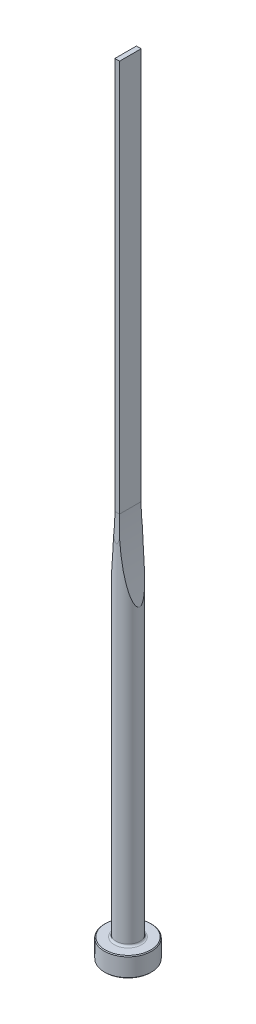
ISO-10303-21;
HEADER;
FILE_DESCRIPTION(('STEP AP214'),'2;1');
FILE_NAME('part.step','',(''),(''),'','','');
FILE_SCHEMA(('AUTOMOTIVE_DESIGN { 1 0 10303 214 1 1 1 1 }'));
ENDSEC;
DATA;
#1=APPLICATION_CONTEXT('core data for automotive mechanical design processes');
#2=APPLICATION_PROTOCOL_DEFINITION('international standard','automotive_design',2000,#1);
#3=PRODUCT_CONTEXT('',#1,'mechanical');
#4=PRODUCT('Part','Part','',(#3));
#5=PRODUCT_RELATED_PRODUCT_CATEGORY('part','',(#4));
#6=PRODUCT_DEFINITION_FORMATION('','',#4);
#7=PRODUCT_DEFINITION_CONTEXT('part definition',#1,'design');
#8=PRODUCT_DEFINITION('design','',#6,#7);
#9=PRODUCT_DEFINITION_SHAPE('','',#8);
#10=(LENGTH_UNIT() NAMED_UNIT(*) SI_UNIT(.MILLI.,.METRE.));
#11=(NAMED_UNIT(*) PLANE_ANGLE_UNIT() SI_UNIT($,.RADIAN.));
#12=(NAMED_UNIT(*) SI_UNIT($,.STERADIAN.) SOLID_ANGLE_UNIT());
#13=UNCERTAINTY_MEASURE_WITH_UNIT(LENGTH_MEASURE(1.E-05),#10,'distance_accuracy_value','');
#14=(GEOMETRIC_REPRESENTATION_CONTEXT(3) GLOBAL_UNCERTAINTY_ASSIGNED_CONTEXT((#13)) GLOBAL_UNIT_ASSIGNED_CONTEXT((#10,
#11,#12)) REPRESENTATION_CONTEXT('',''));
#15=CARTESIAN_POINT('',(0.,0.,0.));
#16=DIRECTION('',(0.,0.,1.));
#17=DIRECTION('',(1.,0.,0.));
#18=AXIS2_PLACEMENT_3D('',#15,#16,#17);
#19=CARTESIAN_POINT('',(0.,0.,0.));
#20=DIRECTION('',(0.,1.,0.));
#21=DIRECTION('',(-1.,0.,0.));
#22=AXIS2_PLACEMENT_3D('',#19,#20,#21);
#23=PLANE('',#22);
#24=CARTESIAN_POINT('',(0.,0.,0.));
#25=DIRECTION('',(0.,1.,0.));
#26=DIRECTION('',(-1.,0.,0.));
#27=AXIS2_PLACEMENT_3D('',#24,#25,#26);
#28=CIRCLE('',#27,5.8);
#29=CARTESIAN_POINT('',(-5.8,0.,0.));
#30=VERTEX_POINT('',#29);
#31=EDGE_CURVE('E133',#30,#30,#28,.T.);
#32=ORIENTED_EDGE('',*,*,#31,.F.);
#33=EDGE_LOOP('',(#32));
#34=FACE_BOUND('',#33,.T.);
#35=ADVANCED_FACE('F32',(#34),#23,.F.);
#36=CARTESIAN_POINT('',(0.,0.,0.));
#37=DIRECTION('',(0.,1.,0.));
#38=DIRECTION('',(-1.,0.,0.));
#39=AXIS2_PLACEMENT_3D('',#36,#37,#38);
#40=CONICAL_SURFACE('',#39,5.8,0.785398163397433);
#41=CARTESIAN_POINT('',(0.,0.200000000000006,0.));
#42=DIRECTION('',(0.,1.,0.));
#43=DIRECTION('',(-1.,0.,0.));
#44=AXIS2_PLACEMENT_3D('',#41,#42,#43);
#45=CIRCLE('',#44,6.);
#46=CARTESIAN_POINT('',(-6.,0.200000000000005,0.));
#47=VERTEX_POINT('',#46);
#48=EDGE_CURVE('E130',#47,#47,#45,.T.);
#49=ORIENTED_EDGE('',*,*,#48,.F.);
#50=EDGE_LOOP('',(#49));
#51=FACE_BOUND('',#50,.T.);
#52=ORIENTED_EDGE('',*,*,#31,.T.);
#53=EDGE_LOOP('',(#52));
#54=FACE_BOUND('',#53,.T.);
#55=ADVANCED_FACE('F171',(#51,#54),#40,.T.);
#56=CARTESIAN_POINT('',(0.,200.,0.));
#57=DIRECTION('',(0.,1.,0.));
#58=DIRECTION('',(-1.,0.,0.));
#59=AXIS2_PLACEMENT_3D('',#56,#57,#58);
#60=CYLINDRICAL_SURFACE('',#59,6.);
#61=CARTESIAN_POINT('',(0.,4.8,0.));
#62=DIRECTION('',(0.,1.,0.));
#63=DIRECTION('',(-1.,0.,0.));
#64=AXIS2_PLACEMENT_3D('',#61,#62,#63);
#65=CIRCLE('',#64,6.);
#66=CARTESIAN_POINT('',(-6.,4.8,0.));
#67=VERTEX_POINT('',#66);
#68=EDGE_CURVE('E127',#67,#67,#65,.T.);
#69=ORIENTED_EDGE('',*,*,#68,.F.);
#70=EDGE_LOOP('',(#69));
#71=FACE_BOUND('',#70,.T.);
#72=ORIENTED_EDGE('',*,*,#48,.T.);
#73=EDGE_LOOP('',(#72));
#74=FACE_BOUND('',#73,.T.);
#75=ADVANCED_FACE('F176',(#71,#74),#60,.T.);
#76=CARTESIAN_POINT('',(0.,4.8,0.));
#77=DIRECTION('',(0.,-1.,0.));
#78=DIRECTION('',(1.,0.,0.));
#79=AXIS2_PLACEMENT_3D('',#76,#77,#78);
#80=CONICAL_SURFACE('',#79,6.,0.785398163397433);
#81=CARTESIAN_POINT('',(0.,5.,0.));
#82=DIRECTION('',(0.,1.,0.));
#83=DIRECTION('',(-1.,0.,0.));
#84=AXIS2_PLACEMENT_3D('',#81,#82,#83);
#85=CIRCLE('',#84,5.8);
#86=CARTESIAN_POINT('',(-5.8,5.,0.));
#87=VERTEX_POINT('',#86);
#88=EDGE_CURVE('E124',#87,#87,#85,.T.);
#89=ORIENTED_EDGE('',*,*,#88,.F.);
#90=EDGE_LOOP('',(#89));
#91=FACE_BOUND('',#90,.T.);
#92=ORIENTED_EDGE('',*,*,#68,.T.);
#93=EDGE_LOOP('',(#92));
#94=FACE_BOUND('',#93,.T.);
#95=ADVANCED_FACE('F183',(#91,#94),#80,.T.);
#96=CARTESIAN_POINT('',(5.8,5.,0.));
#97=DIRECTION('',(0.,-1.,0.));
#98=DIRECTION('',(1.,0.,0.));
#99=AXIS2_PLACEMENT_3D('',#96,#97,#98);
#100=PLANE('',#99);
#101=CARTESIAN_POINT('',(0.,5.,0.));
#102=DIRECTION('',(0.,1.,0.));
#103=DIRECTION('',(-1.,0.,0.));
#104=AXIS2_PLACEMENT_3D('',#101,#102,#103);
#105=CIRCLE('',#104,3.50000000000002);
#106=CARTESIAN_POINT('',(-3.50000000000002,5.,0.));
#107=VERTEX_POINT('',#106);
#108=EDGE_CURVE('E121',#107,#107,#105,.T.);
#109=ORIENTED_EDGE('',*,*,#108,.F.);
#110=EDGE_LOOP('',(#109));
#111=FACE_BOUND('',#110,.T.);
#112=ORIENTED_EDGE('',*,*,#88,.T.);
#113=EDGE_LOOP('',(#112));
#114=FACE_BOUND('',#113,.T.);
#115=ADVANCED_FACE('F190',(#111,#114),#100,.F.);
#116=CARTESIAN_POINT('',(0.,5.5,0.));
#117=DIRECTION('',(0.,1.,0.));
#118=DIRECTION('',(-1.,0.,0.));
#119=AXIS2_PLACEMENT_3D('',#116,#117,#118);
#120=TOROIDAL_SURFACE('',#119,3.50000000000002,0.5);
#121=CARTESIAN_POINT('',(0.,5.50000000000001,0.));
#122=DIRECTION('',(0.,1.,0.));
#123=DIRECTION('',(-1.,0.,0.));
#124=AXIS2_PLACEMENT_3D('',#121,#122,#123);
#125=CIRCLE('',#124,3.00000000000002);
#126=CARTESIAN_POINT('',(-3.00000000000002,5.50000000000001,0.));
#127=VERTEX_POINT('',#126);
#128=EDGE_CURVE('E112',#127,#127,#125,.T.);
#129=ORIENTED_EDGE('',*,*,#128,.F.);
#130=EDGE_LOOP('',(#129));
#131=FACE_BOUND('',#130,.T.);
#132=ORIENTED_EDGE('',*,*,#108,.T.);
#133=EDGE_LOOP('',(#132));
#134=FACE_BOUND('',#133,.T.);
#135=ADVANCED_FACE('F168',(#131,#134),#120,.F.);
#136=CARTESIAN_POINT('',(0.,200.,0.));
#137=DIRECTION('',(0.,1.,0.));
#138=DIRECTION('',(-1.,0.,0.));
#139=AXIS2_PLACEMENT_3D('',#136,#137,#138);
#140=CYLINDRICAL_SURFACE('',#139,3.00000000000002);
#141=CARTESIAN_POINT('',(3.00000000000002,79.3544193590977,0.));
#142=CARTESIAN_POINT('',(2.99999954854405,79.3544212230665,0.0483527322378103));
#143=CARTESIAN_POINT('',(2.99881313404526,79.3594533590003,0.0967104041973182));
#144=CARTESIAN_POINT('',(2.99426254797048,79.3787765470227,0.191463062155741));
#145=CARTESIAN_POINT('',(2.99089325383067,79.393089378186,0.237853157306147));
#146=CARTESIAN_POINT('',(2.98152916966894,79.4329374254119,0.336831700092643));
#147=CARTESIAN_POINT('',(2.97513083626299,79.4602014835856,0.388667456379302));
#148=CARTESIAN_POINT('',(2.96059089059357,79.5223295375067,0.487236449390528));
#149=CARTESIAN_POINT('',(2.95244592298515,79.5572081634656,0.533959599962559));
#150=CARTESIAN_POINT('',(2.9359154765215,79.6282186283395,0.618092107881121));
#151=CARTESIAN_POINT('',(2.92764370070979,79.6638402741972,0.655964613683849));
#152=CARTESIAN_POINT('',(2.91044814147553,79.7381158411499,0.728478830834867));
#153=CARTESIAN_POINT('',(2.901523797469,79.7767723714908,0.763117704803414));
#154=CARTESIAN_POINT('',(2.88320082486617,79.8563951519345,0.829666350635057));
#155=CARTESIAN_POINT('',(2.87380114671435,79.8973665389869,0.861569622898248));
#156=CARTESIAN_POINT('',(2.85468203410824,79.9809836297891,0.922941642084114));
#157=CARTESIAN_POINT('',(2.84496271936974,80.0236287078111,0.952411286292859));
#158=CARTESIAN_POINT('',(2.819689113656,80.134908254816,1.02547116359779));
#159=CARTESIAN_POINT('',(2.80396615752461,80.2045035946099,1.067537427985));
#160=CARTESIAN_POINT('',(2.77218749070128,80.3459768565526,1.14752701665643));
#161=CARTESIAN_POINT('',(2.75613160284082,80.417856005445,1.18544806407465));
#162=CARTESIAN_POINT('',(2.70764400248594,80.6362205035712,1.29422675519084));
#163=CARTESIAN_POINT('',(2.6749458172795,80.7851979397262,1.35995424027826));
#164=CARTESIAN_POINT('',(2.60936263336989,81.0877844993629,1.48189091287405));
#165=CARTESIAN_POINT('',(2.57647755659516,81.2414138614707,1.53804822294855));
#166=CARTESIAN_POINT('',(2.52739820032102,81.4737193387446,1.61653965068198));
#167=CARTESIAN_POINT('',(2.51108896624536,81.5514201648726,1.64173338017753));
#168=CARTESIAN_POINT('',(2.47857216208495,81.7073703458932,1.6904253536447));
#169=CARTESIAN_POINT('',(2.46236458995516,81.7856196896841,1.71392363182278));
#170=CARTESIAN_POINT('',(2.41279480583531,82.0265657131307,1.78375004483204));
#171=CARTESIAN_POINT('',(2.37963510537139,82.1900242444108,1.82759992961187));
#172=CARTESIAN_POINT('',(2.31397739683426,82.5184020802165,1.91004661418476));
#173=CARTESIAN_POINT('',(2.28147949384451,82.683321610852,1.94864258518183));
#174=CARTESIAN_POINT('',(2.21721762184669,83.0143525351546,2.02146122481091));
#175=CARTESIAN_POINT('',(2.18545403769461,83.180464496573,2.05568164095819));
#176=CARTESIAN_POINT('',(2.12273524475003,83.5135705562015,2.12038170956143));
#177=CARTESIAN_POINT('',(2.0917800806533,83.6805647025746,2.15086115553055));
#178=CARTESIAN_POINT('',(2.00004880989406,84.1833980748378,2.23761866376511));
#179=CARTESIAN_POINT('',(1.94055790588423,84.5203110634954,2.28905054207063));
#180=CARTESIAN_POINT('',(1.82523631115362,85.1959867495,2.38200864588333));
#181=CARTESIAN_POINT('',(1.76940460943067,85.534748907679,2.42353761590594));
#182=CARTESIAN_POINT('',(1.66141797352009,86.2142411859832,2.49880495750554));
#183=CARTESIAN_POINT('',(1.60926869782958,86.554973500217,2.53253151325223));
#184=CARTESIAN_POINT('',(1.50881206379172,87.2375840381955,2.59363395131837));
#185=CARTESIAN_POINT('',(1.46050493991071,87.5794623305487,2.62100944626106));
#186=CARTESIAN_POINT('',(1.36784640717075,88.2636554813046,2.67053368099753));
#187=CARTESIAN_POINT('',(1.32348974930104,88.6059691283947,2.69268942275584));
#188=CARTESIAN_POINT('',(1.23869133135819,89.2913239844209,2.7327348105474));
#189=CARTESIAN_POINT('',(1.19824954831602,89.6343651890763,2.75062448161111));
#190=CARTESIAN_POINT('',(1.112583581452,90.3988597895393,2.78653554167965));
#191=CARTESIAN_POINT('',(1.06835244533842,90.8204661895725,2.80366809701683));
#192=CARTESIAN_POINT('',(0.985839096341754,91.6644171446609,2.83373353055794));
#193=CARTESIAN_POINT('',(0.947557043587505,92.086761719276,2.84666629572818));
#194=CARTESIAN_POINT('',(0.876957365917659,92.9320778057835,2.8692017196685));
#195=CARTESIAN_POINT('',(0.844640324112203,93.355049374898,2.87880405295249));
#196=CARTESIAN_POINT('',(0.785986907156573,94.2014638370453,2.89536730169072));
#197=CARTESIAN_POINT('',(0.759650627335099,94.6249067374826,2.90232817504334));
#198=CARTESIAN_POINT('',(0.712944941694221,95.4725634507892,2.91415377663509));
#199=CARTESIAN_POINT('',(0.692581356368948,95.8967776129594,2.91901646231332));
#200=CARTESIAN_POINT('',(0.657860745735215,96.7454697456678,2.92703401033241));
#201=CARTESIAN_POINT('',(0.643503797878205,97.169947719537,2.93018885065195));
#202=CARTESIAN_POINT('',(0.609450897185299,98.4435761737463,2.93754507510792));
#203=CARTESIAN_POINT('',(0.598768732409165,99.2929965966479,2.93963909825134));
#204=CARTESIAN_POINT('',(0.601453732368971,100.990006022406,2.93909086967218));
#205=CARTESIAN_POINT('',(0.614770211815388,101.837595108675,2.9364585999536));
#206=CARTESIAN_POINT('',(0.652696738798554,103.10842087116,2.92816045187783));
#207=CARTESIAN_POINT('',(0.668332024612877,103.531956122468,2.92466918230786));
#208=CARTESIAN_POINT('',(0.70558300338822,104.378743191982,2.91590934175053));
#209=CARTESIAN_POINT('',(0.727198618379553,104.801995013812,2.91064079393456));
#210=CARTESIAN_POINT('',(0.776386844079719,105.647818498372,2.89790728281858));
#211=CARTESIAN_POINT('',(0.803955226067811,106.070390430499,2.8904438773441));
#212=CARTESIAN_POINT('',(0.865048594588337,106.915040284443,2.87275195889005));
#213=CARTESIAN_POINT('',(0.898573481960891,107.337118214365,2.86252349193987));
#214=CARTESIAN_POINT('',(0.971563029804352,108.18061555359,2.83858073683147));
#215=CARTESIAN_POINT('',(1.01102703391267,108.602035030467,2.82486683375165));
#216=CARTESIAN_POINT('',(1.09587742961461,109.444103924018,2.79304679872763));
#217=CARTESIAN_POINT('',(1.14126363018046,109.864753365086,2.77494080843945));
#218=CARTESIAN_POINT('',(1.21662910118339,110.519932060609,2.74238522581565));
#219=CARTESIAN_POINT('',(1.24458388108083,110.754790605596,2.7298405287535));
#220=CARTESIAN_POINT('',(1.30232901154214,111.224164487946,2.70276793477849));
#221=CARTESIAN_POINT('',(1.3321193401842,111.458679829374,2.68824006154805));
#222=CARTESIAN_POINT('',(1.42423718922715,112.161691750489,2.64127299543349));
#223=CARTESIAN_POINT('',(1.48930683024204,112.629613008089,2.60545231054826));
#224=CARTESIAN_POINT('',(1.62662281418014,113.563208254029,2.52202098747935));
#225=CARTESIAN_POINT('',(1.69886646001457,114.028883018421,2.47441477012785));
#226=CARTESIAN_POINT('',(1.81245656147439,114.725061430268,2.39106255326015));
#227=CARTESIAN_POINT('',(1.85118686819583,114.956710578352,2.3612913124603));
#228=CARTESIAN_POINT('',(1.93034560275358,115.41905903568,2.29703587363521));
#229=CARTESIAN_POINT('',(1.97077394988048,115.649758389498,2.26255189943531));
#230=CARTESIAN_POINT('',(2.05334025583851,116.110365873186,2.18789806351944));
#231=CARTESIAN_POINT('',(2.09548110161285,116.340271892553,2.14771828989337));
#232=CARTESIAN_POINT('',(2.18131971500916,116.798551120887,2.06048498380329));
#233=CARTESIAN_POINT('',(2.22501779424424,117.026924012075,2.01343006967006));
#234=CARTESIAN_POINT('',(2.3137921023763,117.481392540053,1.91075197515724));
#235=CARTESIAN_POINT('',(2.35886782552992,117.70748897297,1.85513190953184));
#236=CARTESIAN_POINT('',(2.45014233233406,118.156402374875,1.73282311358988));
#237=CARTESIAN_POINT('',(2.49634052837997,118.379220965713,1.66614007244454));
#238=CARTESIAN_POINT('',(2.56617328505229,118.709840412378,1.55456125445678));
#239=CARTESIAN_POINT('',(2.5895769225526,118.819613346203,1.51537263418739));
#240=CARTESIAN_POINT('',(2.63643492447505,119.037426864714,1.43230444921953));
#241=CARTESIAN_POINT('',(2.65988930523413,119.145466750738,1.38842304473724));
#242=CARTESIAN_POINT('',(2.7066912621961,119.359190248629,1.29482368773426));
#243=CARTESIAN_POINT('',(2.73003870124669,119.464871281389,1.24509968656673));
#244=CARTESIAN_POINT('',(2.77627728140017,119.672443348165,1.13827697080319));
#245=CARTESIAN_POINT('',(2.79916883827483,119.774337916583,1.08118536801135));
#246=CARTESIAN_POINT('',(2.84421494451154,119.973297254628,0.956514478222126));
#247=CARTESIAN_POINT('',(2.86636091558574,120.070309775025,0.888844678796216));
#248=CARTESIAN_POINT('',(2.89788396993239,120.207450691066,0.77700352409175));
#249=CARTESIAN_POINT('',(2.90808585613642,120.251668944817,0.738109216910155));
#250=CARTESIAN_POINT('',(2.92766210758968,120.336249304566,0.656181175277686));
#251=CARTESIAN_POINT('',(2.93703767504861,120.376617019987,0.613153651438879));
#252=CARTESIAN_POINT('',(2.95286393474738,120.444571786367,0.531023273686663));
#253=CARTESIAN_POINT('',(2.95952977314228,120.473121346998,0.492767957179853));
#254=CARTESIAN_POINT('',(2.97174032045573,120.525321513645,0.412789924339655));
#255=CARTESIAN_POINT('',(2.97728453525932,120.548969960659,0.371065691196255));
#256=CARTESIAN_POINT('',(2.98688558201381,120.589867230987,0.283667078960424));
#257=CARTESIAN_POINT('',(2.99092210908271,120.607028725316,0.237948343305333));
#258=CARTESIAN_POINT('',(2.99690909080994,120.632465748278,0.143990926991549));
#259=CARTESIAN_POINT('',(2.99886455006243,120.640762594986,0.0957585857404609));
#260=CARTESIAN_POINT('',(3.00031309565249,120.64690925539,0.00370587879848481));
#261=CARTESIAN_POINT('',(3.00004412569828,120.645768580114,-0.0400433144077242));
#262=CARTESIAN_POINT('',(2.99764218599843,120.635574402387,-0.126566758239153));
#263=CARTESIAN_POINT('',(2.99550742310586,120.626513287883,-0.169340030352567));
#264=CARTESIAN_POINT('',(2.98914571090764,120.599476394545,-0.259584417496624));
#265=CARTESIAN_POINT('',(2.98463061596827,120.580271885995,-0.306658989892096));
#266=CARTESIAN_POINT('',(2.97396142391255,120.534797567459,-0.397031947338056));
#267=CARTESIAN_POINT('',(2.96780425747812,120.508514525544,-0.440323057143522));
#268=CARTESIAN_POINT('',(2.94983205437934,120.431604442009,-0.550830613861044));
#269=CARTESIAN_POINT('',(2.93698705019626,120.376452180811,-0.614685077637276));
#270=CARTESIAN_POINT('',(2.90952748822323,120.257956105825,-0.733746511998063));
#271=CARTESIAN_POINT('',(2.89490771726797,120.194588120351,-0.788926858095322));
#272=CARTESIAN_POINT('',(2.85840241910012,120.035497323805,-0.913992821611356));
#273=CARTESIAN_POINT('',(2.83601822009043,119.937255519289,-0.980485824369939));
#274=CARTESIAN_POINT('',(2.79031862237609,119.735011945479,-1.10382067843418));
#275=CARTESIAN_POINT('',(2.76700129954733,119.630998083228,-1.16064116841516));
#276=CARTESIAN_POINT('',(2.71985245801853,119.418844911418,-1.2672047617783));
#277=CARTESIAN_POINT('',(2.69601887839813,119.310686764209,-1.31690902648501));
#278=CARTESIAN_POINT('',(2.64827520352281,119.092056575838,-1.41045614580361));
#279=CARTESIAN_POINT('',(2.62436521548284,118.981587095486,-1.45430512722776));
#280=CARTESIAN_POINT('',(2.57821293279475,118.76636065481,-1.53453935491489));
#281=CARTESIAN_POINT('',(2.55596620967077,118.661716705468,-1.57122780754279));
#282=CARTESIAN_POINT('',(2.51161973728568,118.451255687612,-1.64118136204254));
#283=CARTESIAN_POINT('',(2.48952000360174,118.345438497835,-1.67444610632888));
#284=CARTESIAN_POINT('',(2.42351886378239,118.026516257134,-1.76990864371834));
#285=CARTESIAN_POINT('',(2.37993617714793,117.812036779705,-1.82774006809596));
#286=CARTESIAN_POINT('',(2.29385170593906,117.380241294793,-1.93466697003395));
#287=CARTESIAN_POINT('',(2.25135244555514,117.162920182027,-1.98374340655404));
#288=CARTESIAN_POINT('',(2.16769555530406,116.726532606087,-2.07482958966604));
#289=CARTESIAN_POINT('',(2.12653806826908,116.507465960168,-2.1168385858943));
#290=CARTESIAN_POINT('',(2.04560034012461,116.067619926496,-2.19515180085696));
#291=CARTESIAN_POINT('',(2.00582293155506,115.84683803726,-2.23144477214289));
#292=CARTESIAN_POINT('',(1.92779808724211,115.404256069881,-2.29918715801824));
#293=CARTESIAN_POINT('',(1.88955073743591,115.182455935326,-2.3306363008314));
#294=CARTESIAN_POINT('',(1.81468937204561,114.73835991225,-2.38938543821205));
#295=CARTESIAN_POINT('',(1.77807314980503,114.516065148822,-2.41669116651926));
#296=CARTESIAN_POINT('',(1.70645210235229,114.07082057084,-2.46778257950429));
#297=CARTESIAN_POINT('',(1.671447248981,113.847870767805,-2.49156832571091));
#298=CARTESIAN_POINT('',(1.56911137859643,113.179661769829,-2.55822914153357));
#299=CARTESIAN_POINT('',(1.50421176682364,112.733576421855,-2.59659480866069));
#300=CARTESIAN_POINT('',(1.38103837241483,111.839782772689,-2.66414008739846));
#301=CARTESIAN_POINT('',(1.32276521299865,111.392074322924,-2.69331883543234));
#302=CARTESIAN_POINT('',(1.21290377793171,110.495292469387,-2.74454680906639));
#303=CARTESIAN_POINT('',(1.16131763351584,110.046218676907,-2.7665937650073));
#304=CARTESIAN_POINT('',(1.0648958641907,109.147106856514,-2.80511813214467));
#305=CARTESIAN_POINT('',(1.02006035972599,108.697068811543,-2.82159544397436));
#306=CARTESIAN_POINT('',(0.93709683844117,107.795453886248,-2.85022399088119));
#307=CARTESIAN_POINT('',(0.898980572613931,107.343875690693,-2.86236768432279));
#308=CARTESIAN_POINT('',(0.829568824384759,106.440115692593,-2.88324951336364));
#309=CARTESIAN_POINT('',(0.798273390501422,105.987933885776,-2.89198762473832));
#310=CARTESIAN_POINT('',(0.742520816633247,105.083189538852,-2.90680131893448));
#311=CARTESIAN_POINT('',(0.718062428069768,104.63062708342,-2.91287738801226));
#312=CARTESIAN_POINT('',(0.675984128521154,103.725155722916,-2.9229288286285));
#313=CARTESIAN_POINT('',(0.658364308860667,103.272246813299,-2.92690417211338));
#314=CARTESIAN_POINT('',(0.629994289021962,102.367016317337,-2.93314123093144));
#315=CARTESIAN_POINT('',(0.619231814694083,101.914695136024,-2.93540600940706));
#316=CARTESIAN_POINT('',(0.604529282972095,101.009929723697,-2.93846909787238));
#317=CARTESIAN_POINT('',(0.600589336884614,100.557485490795,-2.93926738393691));
#318=CARTESIAN_POINT('',(0.599533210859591,99.6525553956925,-2.93948298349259));
#319=CARTESIAN_POINT('',(0.602417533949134,99.2000695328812,-2.93890019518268));
#320=CARTESIAN_POINT('',(0.61501012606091,98.2952041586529,-2.93629085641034));
#321=CARTESIAN_POINT('',(0.624718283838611,97.8428246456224,-2.93426432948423));
#322=CARTESIAN_POINT('',(0.650943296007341,96.9387039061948,-2.92855815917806));
#323=CARTESIAN_POINT('',(0.667453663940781,96.4869624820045,-2.92488009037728));
#324=CARTESIAN_POINT('',(0.707277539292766,95.5838066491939,-2.91550637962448));
#325=CARTESIAN_POINT('',(0.730590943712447,95.1323922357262,-2.90981076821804));
#326=CARTESIAN_POINT('',(0.784010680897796,94.2300511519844,-2.89587454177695));
#327=CARTESIAN_POINT('',(0.814116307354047,93.779124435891,-2.88763419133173));
#328=CARTESIAN_POINT('',(0.88111005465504,92.8778533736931,-2.86790293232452));
#329=CARTESIAN_POINT('',(0.917998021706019,92.4275090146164,-2.85641209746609));
#330=CARTESIAN_POINT('',(0.989843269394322,91.624721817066,-2.83219298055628));
#331=CARTESIAN_POINT('',(1.02349736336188,91.2721377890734,-2.82026773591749));
#332=CARTESIAN_POINT('',(1.09495320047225,90.567502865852,-2.79330218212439));
#333=CARTESIAN_POINT('',(1.13275499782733,90.2154519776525,-2.77826183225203));
#334=CARTESIAN_POINT('',(1.21247129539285,89.5121549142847,-2.74441085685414));
#335=CARTESIAN_POINT('',(1.25438393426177,89.1609084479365,-2.72560193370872));
#336=CARTESIAN_POINT('',(1.34230956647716,88.4592142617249,-2.68338899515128));
#337=CARTESIAN_POINT('',(1.38832247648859,88.1087665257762,-2.65998507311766));
#338=CARTESIAN_POINT('',(1.50174960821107,87.2825803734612,-2.59814180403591));
#339=CARTESIAN_POINT('',(1.57089655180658,86.8072470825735,-2.5573241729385));
#340=CARTESIAN_POINT('',(1.68014772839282,86.0961366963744,-2.48575504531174));
#341=CARTESIAN_POINT('',(1.71748757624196,85.8594089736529,-2.46017412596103));
#342=CARTESIAN_POINT('',(1.79397886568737,85.386720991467,-2.4049675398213));
#343=CARTESIAN_POINT('',(1.83313026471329,85.1507607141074,-2.37534196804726));
#344=CARTESIAN_POINT('',(1.92804621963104,84.5924756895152,-2.29947574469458));
#345=CARTESIAN_POINT('',(1.98458899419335,84.2705620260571,-2.25114705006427));
#346=CARTESIAN_POINT('',(2.10083962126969,83.6291482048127,-2.1430847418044));
#347=CARTESIAN_POINT('',(2.16054773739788,83.3096482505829,-2.08335017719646));
#348=CARTESIAN_POINT('',(2.26396974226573,82.772234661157,-1.96935933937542));
#349=CARTESIAN_POINT('',(2.30694621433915,82.553339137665,-1.9190816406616));
#350=CARTESIAN_POINT('',(2.39404167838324,82.1182201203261,-1.80928432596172));
#351=CARTESIAN_POINT('',(2.43815985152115,81.9019948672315,-1.74977118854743));
#352=CARTESIAN_POINT('',(2.51383172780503,81.5378652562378,-1.63820252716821));
#353=CARTESIAN_POINT('',(2.54517613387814,81.3889602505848,-1.58928214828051));
#354=CARTESIAN_POINT('',(2.60812136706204,81.093596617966,-1.48374973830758));
#355=CARTESIAN_POINT('',(2.63972253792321,80.9471425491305,-1.42712485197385));
#356=CARTESIAN_POINT('',(2.68802167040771,80.7259168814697,-1.33262383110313));
#357=CARTESIAN_POINT('',(2.70478476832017,80.6496220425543,-1.29834782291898));
#358=CARTESIAN_POINT('',(2.73816263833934,80.4986281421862,-1.22639444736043));
#359=CARTESIAN_POINT('',(2.75477744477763,80.4239287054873,-1.18871789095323));
#360=CARTESIAN_POINT('',(2.78767783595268,80.2768730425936,-1.10936597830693));
#361=CARTESIAN_POINT('',(2.80396421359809,80.204510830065,-1.06770213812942));
#362=CARTESIAN_POINT('',(2.83603012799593,80.0628273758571,-0.979360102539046));
#363=CARTESIAN_POINT('',(2.85181006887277,79.9935036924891,-0.932686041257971));
#364=CARTESIAN_POINT('',(2.87943742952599,79.8727563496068,-0.842958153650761));
#365=CARTESIAN_POINT('',(2.89143999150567,79.8205263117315,-0.801048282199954));
#366=CARTESIAN_POINT('',(2.91460908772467,79.7200868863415,-0.712158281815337));
#367=CARTESIAN_POINT('',(2.92577385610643,79.6718859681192,-0.665167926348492));
#368=CARTESIAN_POINT('',(2.94687801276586,79.581077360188,-0.56445022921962));
#369=CARTESIAN_POINT('',(2.95679810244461,79.5385572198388,-0.510637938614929));
#370=CARTESIAN_POINT('',(2.97430949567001,79.4636945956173,-0.395983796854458));
#371=CARTESIAN_POINT('',(2.98191077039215,79.4313085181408,-0.335173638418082));
#372=CARTESIAN_POINT('',(2.99163165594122,79.389951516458,-0.228060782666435));
#373=CARTESIAN_POINT('',(2.99473052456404,79.3767888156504,-0.183494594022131));
#374=CARTESIAN_POINT('',(2.99891293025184,79.3590302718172,-0.0926180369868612));
#375=CARTESIAN_POINT('',(3.00000043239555,79.3544175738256,-0.046311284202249));
#376=CARTESIAN_POINT('',(3.00000000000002,79.3544193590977,0.));
#377=B_SPLINE_CURVE_WITH_KNOTS('',3,(#141,#142,#143,#144,#145,#146,#147,#148,#149,#150,#151,
#152,#153,#154,#155,#156,#157,#158,#159,#160,#161,#162,#163,#164,#165,#166,#167,#168,#169,#170,
#171,#172,#173,#174,#175,#176,#177,#178,#179,#180,#181,#182,#183,#184,#185,#186,#187,#188,#189,
#190,#191,#192,#193,#194,#195,#196,#197,#198,#199,#200,#201,#202,#203,#204,#205,#206,#207,#208,
#209,#210,#211,#212,#213,#214,#215,#216,#217,#218,#219,#220,#221,#222,#223,#224,#225,#226,#227,
#228,#229,#230,#231,#232,#233,#234,#235,#236,#237,#238,#239,#240,#241,#242,#243,#244,#245,#246,
#247,#248,#249,#250,#251,#252,#253,#254,#255,#256,#257,#258,#259,#260,#261,#262,#263,#264,#265,
#266,#267,#268,#269,#270,#271,#272,#273,#274,#275,#276,#277,#278,#279,#280,#281,#282,#283,#284,
#285,#286,#287,#288,#289,#290,#291,#292,#293,#294,#295,#296,#297,#298,#299,#300,#301,#302,#303,
#304,#305,#306,#307,#308,#309,#310,#311,#312,#313,#314,#315,#316,#317,#318,#319,#320,#321,#322,
#323,#324,#325,#326,#327,#328,#329,#330,#331,#332,#333,#334,#335,#336,#337,#338,#339,#340,#341,
#342,#343,#344,#345,#346,#347,#348,#349,#350,#351,#352,#353,#354,#355,#356,#357,#358,#359,#360,
#361,#362,#363,#364,#365,#366,#367,#368,#369,#370,#371,#372,#373,#374,#375,#376),.UNSPECIFIED.,
.T.,.F.,(4,2,2,2,2,2,2,2,2,2,2,2,2,2,2,2,2,2,2,2,2,2,2,2,2,2,2,2,2,2,2,2,2,2,2,2,2,2,2,2,2,2,2,
2,2,2,2,2,2,2,2,2,2,2,2,2,2,2,2,2,2,2,2,2,2,2,2,2,2,2,2,2,2,2,2,2,2,2,2,2,2,2,2,2,2,2,2,2,2,2,2,
2,2,2,2,2,2,2,2,2,2,2,2,2,2,2,2,2,2,2,2,2,2,2,2,2,2,4),(0.,0.144818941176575,0.289978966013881,
0.465715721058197,0.64179314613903,0.799504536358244,0.957353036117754,1.11556674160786,
1.27372185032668,1.52200926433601,1.77043237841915,2.26811973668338,2.76842457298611,
3.01829386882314,3.26815812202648,3.7854045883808,4.30273255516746,4.82032577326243,
5.33794754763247,6.37561556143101,7.41299565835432,8.45193660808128,9.49094091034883,
10.5285434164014,11.5661398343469,12.838867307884,14.1116290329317,15.3845151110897,
16.6574214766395,17.9315642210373,19.2057233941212,21.7538152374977,24.2965317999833,
25.5680080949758,26.8394678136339,28.1100272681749,29.3805655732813,30.6509635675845,
31.9213205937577,32.6318531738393,33.3423772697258,34.7635500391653,36.1841905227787,
36.8943791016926,37.6045339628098,38.3159401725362,39.0274895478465,39.7387807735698,
40.4497073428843,40.8062812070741,41.162995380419,41.5200821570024,41.8768267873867,
42.2368103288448,42.4159185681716,42.5947617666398,42.7390562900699,42.8834142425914,
43.0296516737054,43.1755366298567,43.306035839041,43.4366606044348,43.5889377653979,
43.7415015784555,43.996097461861,44.2514601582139,44.6127315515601,44.974790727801,
45.3387562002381,45.7023377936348,46.0415653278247,46.3808282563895,47.0596667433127,
47.7399640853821,48.4203336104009,49.1020256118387,49.7837558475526,50.4645339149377,
51.1453000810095,52.5023375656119,53.8595025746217,55.2170990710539,56.5747197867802,
57.9346917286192,59.2946733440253,60.6544064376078,62.0141576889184,63.3714681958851,
64.7288008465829,66.086233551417,67.4436441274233,68.7997632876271,70.1558619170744,
71.5118195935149,72.8677465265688,73.9308736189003,74.9940146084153,76.0566764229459,
77.1193166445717,78.5652732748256,79.2882874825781,80.011284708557,81.0023058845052,
81.9934097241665,82.6792779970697,83.3646672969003,83.8440461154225,84.3242348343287,
84.5800836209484,84.8358715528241,85.0909418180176,85.345803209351,85.5496747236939,
85.7539645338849,85.9611084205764,86.167348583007,86.3063275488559,86.4450322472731),.UNSPECIFIED.);
#378=CARTESIAN_POINT('',(0.753763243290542,94.7413175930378,-2.90376324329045));
#379=VERTEX_POINT('',#378);
#380=CARTESIAN_POINT('',(0.753763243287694,94.741317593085,2.90376324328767));
#381=VERTEX_POINT('',#380);
#382=EDGE_CURVE('E138',#379,#381,#377,.T.);
#383=ORIENTED_EDGE('',*,*,#382,.T.);
#384=CARTESIAN_POINT('',(-1.19895788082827,100.,2.74999999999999));
#385=CARTESIAN_POINT('',(-1.19897952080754,100.507824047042,2.7500005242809));
#386=CARTESIAN_POINT('',(-1.18927252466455,101.015682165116,2.7543014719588));
#387=CARTESIAN_POINT('',(-1.15875125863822,101.7777588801,2.76719867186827));
#388=CARTESIAN_POINT('',(-1.14587302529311,102.032372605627,2.77259034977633));
#389=CARTESIAN_POINT('',(-1.11408427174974,102.541075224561,2.7855202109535));
#390=CARTESIAN_POINT('',(-1.0951762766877,102.795164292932,2.79305749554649));
#391=CARTESIAN_POINT('',(-1.0505448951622,103.299287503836,2.81014523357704));
#392=CARTESIAN_POINT('',(-1.02491501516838,103.549330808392,2.81966772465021));
#393=CARTESIAN_POINT('',(-0.964932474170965,104.048715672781,2.84076574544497));
#394=CARTESIAN_POINT('',(-0.930566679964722,104.298055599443,2.85234435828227));
#395=CARTESIAN_POINT('',(-0.870049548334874,104.669653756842,2.87113933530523));
#396=CARTESIAN_POINT('',(-0.848472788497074,104.792694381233,2.87761721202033));
#397=CARTESIAN_POINT('',(-0.801568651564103,105.038027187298,2.89103629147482));
#398=CARTESIAN_POINT('',(-0.7762418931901,105.160319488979,2.89797741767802));
#399=CARTESIAN_POINT('',(-0.720753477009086,105.403474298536,2.91227256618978));
#400=CARTESIAN_POINT('',(-0.690603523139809,105.52433952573,2.91962556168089));
#401=CARTESIAN_POINT('',(-0.623527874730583,105.764129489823,2.93469409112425));
#402=CARTESIAN_POINT('',(-0.586609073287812,105.883056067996,2.94240925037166));
#403=CARTESIAN_POINT('',(-0.53222534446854,106.033125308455,2.95243594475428));
#404=CARTESIAN_POINT('',(-0.519782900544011,106.066091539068,2.9546570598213));
#405=CARTESIAN_POINT('',(-0.493824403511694,106.131601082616,2.95910656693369));
#406=CARTESIAN_POINT('',(-0.480308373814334,106.164144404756,2.96133495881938));
#407=CARTESIAN_POINT('',(-0.437923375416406,106.26078152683,2.96800415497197));
#408=CARTESIAN_POINT('',(-0.40716074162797,106.324045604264,2.97243989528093));
#409=CARTESIAN_POINT('',(-0.339480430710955,106.443295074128,2.98092262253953));
#410=CARTESIAN_POINT('',(-0.302974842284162,106.499488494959,2.98497775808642));
#411=CARTESIAN_POINT('',(-0.243249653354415,106.570609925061,2.99016761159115));
#412=CARTESIAN_POINT('',(-0.22538065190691,106.589912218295,2.99158318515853));
#413=CARTESIAN_POINT('',(-0.187063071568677,106.625785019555,2.99422420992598));
#414=CARTESIAN_POINT('',(-0.166623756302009,106.642364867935,2.9954503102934));
#415=CARTESIAN_POINT('',(-0.132225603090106,106.66474699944,2.9971102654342));
#416=CARTESIAN_POINT('',(-0.11929686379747,106.672106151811,2.99765718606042));
#417=CARTESIAN_POINT('',(-0.0924786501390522,106.684833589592,2.99860424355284));
#418=CARTESIAN_POINT('',(-0.0785901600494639,106.690203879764,2.99900452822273));
#419=CARTESIAN_POINT('',(-0.0498799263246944,106.698454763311,2.99961993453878));
#420=CARTESIAN_POINT('',(-0.0350488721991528,106.701304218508,2.99983274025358));
#421=CARTESIAN_POINT('',(-0.00511706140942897,106.703983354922,3.00003281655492));
#422=CARTESIAN_POINT('',(0.00998340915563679,106.703816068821,3.00002031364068));
#423=CARTESIAN_POINT('',(0.0377473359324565,106.70073399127,2.99979016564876));
#424=CARTESIAN_POINT('',(0.0504568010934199,106.698205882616,2.99960139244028));
#425=CARTESIAN_POINT('',(0.0753269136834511,106.691216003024,2.9990800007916));
#426=CARTESIAN_POINT('',(0.0874870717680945,106.686752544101,2.99874725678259));
#427=CARTESIAN_POINT('',(0.117304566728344,106.673490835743,2.99776000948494));
#428=CARTESIAN_POINT('',(0.134490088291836,106.66364736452,2.99702831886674));
#429=CARTESIAN_POINT('',(0.167153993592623,106.641469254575,2.99538445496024));
#430=CARTESIAN_POINT('',(0.182627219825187,106.629127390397,2.9944717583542));
#431=CARTESIAN_POINT('',(0.225718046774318,106.590611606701,2.99163284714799));
#432=CARTESIAN_POINT('',(0.251307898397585,106.56221507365,2.98955095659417));
#433=CARTESIAN_POINT('',(0.298583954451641,106.502395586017,2.98519748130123));
#434=CARTESIAN_POINT('',(0.320256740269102,106.470962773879,2.98292528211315));
#435=CARTESIAN_POINT('',(0.376076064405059,106.38210264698,2.9765520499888));
#436=CARTESIAN_POINT('',(0.407351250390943,106.322898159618,2.97236032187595));
#437=CARTESIAN_POINT('',(0.464715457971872,106.201991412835,2.96392635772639));
#438=CARTESIAN_POINT('',(0.490790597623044,106.140282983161,2.95968401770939));
#439=CARTESIAN_POINT('',(0.539393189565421,106.01515332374,2.95121450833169));
#440=CARTESIAN_POINT('',(0.561903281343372,105.951725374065,2.94698750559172));
#441=CARTESIAN_POINT('',(0.604138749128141,105.824059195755,2.93861747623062));
#442=CARTESIAN_POINT('',(0.623867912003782,105.759822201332,2.93447434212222));
#443=CARTESIAN_POINT('',(0.687009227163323,105.541602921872,2.92063784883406));
#444=CARTESIAN_POINT('',(0.72550257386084,105.386187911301,2.91118093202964));
#445=CARTESIAN_POINT('',(0.794909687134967,105.073609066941,2.89298537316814));
#446=CARTESIAN_POINT('',(0.825818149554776,104.916444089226,2.88424723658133));
#447=CARTESIAN_POINT('',(0.882130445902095,104.600671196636,2.86752741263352));
#448=CARTESIAN_POINT('',(0.907519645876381,104.442060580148,2.8595477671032));
#449=CARTESIAN_POINT('',(0.953912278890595,104.124222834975,2.84440447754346));
#450=CARTESIAN_POINT('',(0.974917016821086,103.964995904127,2.83724059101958));
#451=CARTESIAN_POINT('',(1.03276252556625,103.485151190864,2.81693320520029));
#452=CARTESIAN_POINT('',(1.06419241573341,103.163825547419,2.8050512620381));
#453=CARTESIAN_POINT('',(1.11623470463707,102.520879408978,2.78473743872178));
#454=CARTESIAN_POINT('',(1.13686835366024,102.199260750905,2.77629878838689));
#455=CARTESIAN_POINT('',(1.16917424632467,101.55466711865,2.76284984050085));
#456=CARTESIAN_POINT('',(1.18082300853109,101.23169079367,2.75784852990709));
#457=CARTESIAN_POINT('',(1.19594203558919,100.58551072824,2.75132454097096));
#458=CARTESIAN_POINT('',(1.1994121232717,100.262306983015,2.74980193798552));
#459=CARTESIAN_POINT('',(1.19840705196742,99.6145622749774,2.7502401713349));
#460=CARTESIAN_POINT('',(1.19389860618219,99.2900213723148,2.75221560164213));
#461=CARTESIAN_POINT('',(1.17656472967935,98.6413194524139,2.75967187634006));
#462=CARTESIAN_POINT('',(1.16374248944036,98.3171583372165,2.76515137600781));
#463=CARTESIAN_POINT('',(1.12903192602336,97.6736789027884,2.77950240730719));
#464=CARTESIAN_POINT('',(1.10726533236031,97.3543530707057,2.78832827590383));
#465=CARTESIAN_POINT('',(1.05280621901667,96.7162712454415,2.80935794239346));
#466=CARTESIAN_POINT('',(1.02009944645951,96.3975165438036,2.82156614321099));
#467=CARTESIAN_POINT('',(0.960080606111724,95.9219501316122,2.84230016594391));
#468=CARTESIAN_POINT('',(0.938338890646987,95.7643795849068,2.84958669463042));
#469=CARTESIAN_POINT('',(0.890325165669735,95.4498925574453,2.86495508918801));
#470=CARTESIAN_POINT('',(0.864051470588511,95.2929763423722,2.87303725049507));
#471=CARTESIAN_POINT('',(0.805707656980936,94.9806378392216,2.88993979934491));
#472=CARTESIAN_POINT('',(0.773651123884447,94.8252129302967,2.89875843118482));
#473=CARTESIAN_POINT('',(0.701473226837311,94.5163138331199,2.91708269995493));
#474=CARTESIAN_POINT('',(0.661358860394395,94.362838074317,2.92658773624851));
#475=CARTESIAN_POINT('',(0.599571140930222,94.1622791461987,2.93951368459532));
#476=CARTESIAN_POINT('',(0.583753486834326,94.113382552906,2.94270568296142));
#477=CARTESIAN_POINT('',(0.550376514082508,94.0161514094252,2.94913181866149));
#478=CARTESIAN_POINT('',(0.53281618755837,93.9678172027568,2.9523659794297));
#479=CARTESIAN_POINT('',(0.495474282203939,93.8718768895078,2.95886221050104));
#480=CARTESIAN_POINT('',(0.475687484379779,93.824272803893,2.96212432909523));
#481=CARTESIAN_POINT('',(0.433230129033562,93.7303798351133,2.96863184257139));
#482=CARTESIAN_POINT('',(0.410562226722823,93.6840897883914,2.97187725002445));
#483=CARTESIAN_POINT('',(0.360948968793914,93.5932525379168,2.97831355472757));
#484=CARTESIAN_POINT('',(0.333963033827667,93.5487274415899,2.98150358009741));
#485=CARTESIAN_POINT('',(0.273823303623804,93.4640019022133,2.98763333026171));
#486=CARTESIAN_POINT('',(0.240714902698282,93.423772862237,2.99057467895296));
#487=CARTESIAN_POINT('',(0.187908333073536,93.3753088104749,2.9941441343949));
#488=CARTESIAN_POINT('',(0.17244376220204,93.3625865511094,2.99508437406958));
#489=CARTESIAN_POINT('',(0.139769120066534,93.3396025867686,2.99678704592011));
#490=CARTESIAN_POINT('',(0.122564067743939,93.3293340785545,2.99754996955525));
#491=CARTESIAN_POINT('',(0.0920979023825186,93.3150686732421,2.99861155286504));
#492=CARTESIAN_POINT('',(0.079292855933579,93.3101148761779,2.99898077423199));
#493=CARTESIAN_POINT('',(0.0530412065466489,93.3023526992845,2.99955968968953));
#494=CARTESIAN_POINT('',(0.0395953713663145,93.2995418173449,2.99976956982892));
#495=CARTESIAN_POINT('',(0.0123234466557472,93.2963783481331,3.00000579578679));
#496=CARTESIAN_POINT('',(-0.00150445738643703,93.2960408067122,3.00003101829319));
#497=CARTESIAN_POINT('',(-0.0289863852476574,93.2979088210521,2.99989150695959));
#498=CARTESIAN_POINT('',(-0.0426403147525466,93.3001157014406,2.99972667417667));
#499=CARTESIAN_POINT('',(-0.0713132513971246,93.3072893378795,2.99919143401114));
#500=CARTESIAN_POINT('',(-0.0862409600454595,93.3126116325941,2.99879455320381));
#501=CARTESIAN_POINT('',(-0.115034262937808,93.3255893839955,2.99782852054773));
#502=CARTESIAN_POINT('',(-0.128897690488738,93.3332494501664,2.9972590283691));
#503=CARTESIAN_POINT('',(-0.16396857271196,93.3556775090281,2.99559526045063));
#504=CARTESIAN_POINT('',(-0.184247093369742,93.3718697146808,2.99439742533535));
#505=CARTESIAN_POINT('',(-0.222285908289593,93.4069419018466,2.99181430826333));
#506=CARTESIAN_POINT('',(-0.240038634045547,93.4258296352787,2.99042848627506));
#507=CARTESIAN_POINT('',(-0.280818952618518,93.4738008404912,2.98692562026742));
#508=CARTESIAN_POINT('',(-0.302801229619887,93.5037572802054,2.98475182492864));
#509=CARTESIAN_POINT('',(-0.343876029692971,93.5656071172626,2.9802970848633));
#510=CARTESIAN_POINT('',(-0.362961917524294,93.5975047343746,2.97801590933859));
#511=CARTESIAN_POINT('',(-0.417189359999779,93.695283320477,2.97107815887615));
#512=CARTESIAN_POINT('',(-0.449076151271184,93.7629467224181,2.96634960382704));
#513=CARTESIAN_POINT('',(-0.507522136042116,93.9004515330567,2.95690285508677));
#514=CARTESIAN_POINT('',(-0.534078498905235,93.970294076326,2.95218466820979));
#515=CARTESIAN_POINT('',(-0.58343718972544,94.1113147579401,2.94282667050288));
#516=CARTESIAN_POINT('',(-0.606238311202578,94.1824933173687,2.93818688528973));
#517=CARTESIAN_POINT('',(-0.670588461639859,94.3976071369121,2.92442540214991));
#518=CARTESIAN_POINT('',(-0.707956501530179,94.5427891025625,2.91548441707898));
#519=CARTESIAN_POINT('',(-0.775545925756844,94.8347309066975,2.89822529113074));
#520=CARTESIAN_POINT('',(-0.805769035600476,94.9814903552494,2.88990700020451));
#521=CARTESIAN_POINT('',(-0.860937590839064,95.2758101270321,2.8739536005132));
#522=CARTESIAN_POINT('',(-0.885890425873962,95.4233690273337,2.86631754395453));
#523=CARTESIAN_POINT('',(-0.937056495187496,95.7534864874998,2.850053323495));
#524=CARTESIAN_POINT('',(-0.962216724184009,95.9362151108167,2.841606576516));
#525=CARTESIAN_POINT('',(-1.00766798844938,96.302332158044,2.82580502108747));
#526=CARTESIAN_POINT('',(-1.02795847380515,96.4857206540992,2.81845033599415));
#527=CARTESIAN_POINT('',(-1.08284239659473,97.036928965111,2.79803797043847));
#528=CARTESIAN_POINT('',(-1.11139411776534,97.4054154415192,2.78665055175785));
#529=CARTESIAN_POINT('',(-1.15618392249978,98.1449701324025,2.768355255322));
#530=CARTESIAN_POINT('',(-1.17236247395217,98.516042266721,2.7614690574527));
#531=CARTESIAN_POINT('',(-1.19373453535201,99.2580705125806,2.75229417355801));
#532=CARTESIAN_POINT('',(-1.19894207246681,99.6290261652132,2.74999961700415));
#533=CARTESIAN_POINT('',(-1.19895788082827,100.,2.74999999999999));
#534=B_SPLINE_CURVE_WITH_KNOTS('',3,(#384,#385,#386,#387,#388,#389,#390,#391,#392,#393,#394,
#395,#396,#397,#398,#399,#400,#401,#402,#403,#404,#405,#406,#407,#408,#409,#410,#411,#412,#413,
#414,#415,#416,#417,#418,#419,#420,#421,#422,#423,#424,#425,#426,#427,#428,#429,#430,#431,#432,
#433,#434,#435,#436,#437,#438,#439,#440,#441,#442,#443,#444,#445,#446,#447,#448,#449,#450,#451,
#452,#453,#454,#455,#456,#457,#458,#459,#460,#461,#462,#463,#464,#465,#466,#467,#468,#469,#470,
#471,#472,#473,#474,#475,#476,#477,#478,#479,#480,#481,#482,#483,#484,#485,#486,#487,#488,#489,
#490,#491,#492,#493,#494,#495,#496,#497,#498,#499,#500,#501,#502,#503,#504,#505,#506,#507,#508,
#509,#510,#511,#512,#513,#514,#515,#516,#517,#518,#519,#520,#521,#522,#523,#524,#525,#526,#527,
#528,#529,#530,#531,#532,#533),.UNSPECIFIED.,.T.,.F.,(4,2,2,2,2,2,2,2,2,2,2,2,2,2,2,2,2,2,2,2,2,
2,2,2,2,2,2,2,2,2,2,2,2,2,2,2,2,2,2,2,2,2,2,2,2,2,2,2,2,2,2,2,2,2,2,2,2,2,2,2,2,2,2,2,2,2,2,2,2,
2,2,2,2,2,4),(0.,1.5233619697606,2.28829204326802,3.05290220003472,3.8073935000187,
4.56302584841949,4.93824292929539,5.31339817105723,5.68765649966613,6.0615357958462,
6.16744011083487,6.27334211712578,6.48462856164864,6.68472896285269,6.76359605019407,
6.8421866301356,6.88671949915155,6.93120735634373,6.97623736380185,7.02122210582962,
7.0599290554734,7.09866983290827,7.15778245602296,7.21706854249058,7.33127335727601,
7.44586227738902,7.64659681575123,7.84786026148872,8.05007550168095,8.25201266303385,
8.73281405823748,9.21395072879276,9.69634794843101,10.1786013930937,11.1475377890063,
12.1145597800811,13.0841005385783,14.0536622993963,15.0272786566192,16.0005216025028,
16.9609360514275,17.9226066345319,18.4002500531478,18.8780715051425,19.3547847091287,
19.831085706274,19.9855333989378,20.1400709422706,20.2949785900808,20.4497444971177,
20.6060609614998,20.7612618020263,20.8212505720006,20.8810710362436,20.9221243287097,
20.9631296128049,21.0043841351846,21.0456601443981,21.0929554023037,21.140344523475,
21.2178364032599,21.2955558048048,21.40693457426,21.518564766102,21.7429487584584,
21.9674515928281,22.1920264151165,22.6422403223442,23.0923453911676,23.5418150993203,
24.0956643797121,24.6495761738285,25.7585400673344,26.8728066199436,27.9856476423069),.UNSPECIFIED.);
#535=CARTESIAN_POINT('',(-0.753763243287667,94.7413175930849,2.90376324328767));
#536=VERTEX_POINT('',#535);
#537=EDGE_CURVE('E104',#381,#536,#534,.T.);
#538=ORIENTED_EDGE('',*,*,#537,.T.);
#539=CARTESIAN_POINT('',(-3.00000000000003,79.3544193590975,0.));
#540=CARTESIAN_POINT('',(-2.99999954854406,79.3544212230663,-0.0483527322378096));
#541=CARTESIAN_POINT('',(-2.99881313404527,79.359453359,-0.0967104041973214));
#542=CARTESIAN_POINT('',(-2.99426254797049,79.3787765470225,-0.191463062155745));
#543=CARTESIAN_POINT('',(-2.99089325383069,79.3930893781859,-0.237853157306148));
#544=CARTESIAN_POINT('',(-2.98152916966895,79.4329374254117,-0.336831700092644));
#545=CARTESIAN_POINT('',(-2.97513083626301,79.4602014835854,-0.388667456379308));
#546=CARTESIAN_POINT('',(-2.96059089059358,79.5223295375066,-0.487236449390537));
#547=CARTESIAN_POINT('',(-2.95244592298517,79.5572081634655,-0.533959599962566));
#548=CARTESIAN_POINT('',(-2.9359154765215,79.6282186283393,-0.618092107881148));
#549=CARTESIAN_POINT('',(-2.92764370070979,79.6638402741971,-0.655964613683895));
#550=CARTESIAN_POINT('',(-2.91044814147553,79.7381158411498,-0.728478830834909));
#551=CARTESIAN_POINT('',(-2.90152379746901,79.7767723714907,-0.763117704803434));
#552=CARTESIAN_POINT('',(-2.88320082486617,79.8563951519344,-0.829666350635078));
#553=CARTESIAN_POINT('',(-2.87380114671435,79.8973665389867,-0.861569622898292));
#554=CARTESIAN_POINT('',(-2.85468203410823,79.9809836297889,-0.922941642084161));
#555=CARTESIAN_POINT('',(-2.84496271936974,80.0236287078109,-0.952411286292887));
#556=CARTESIAN_POINT('',(-2.819689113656,80.1349082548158,-1.0254711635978));
#557=CARTESIAN_POINT('',(-2.80396615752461,80.2045035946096,-1.06753742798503));
#558=CARTESIAN_POINT('',(-2.77218749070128,80.3459768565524,-1.14752701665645));
#559=CARTESIAN_POINT('',(-2.75613160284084,80.4178560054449,-1.18544806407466));
#560=CARTESIAN_POINT('',(-2.70764400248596,80.6362205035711,-1.2942267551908));
#561=CARTESIAN_POINT('',(-2.67494581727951,80.7851979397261,-1.35995424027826));
#562=CARTESIAN_POINT('',(-2.60936263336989,81.0877844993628,-1.48189091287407));
#563=CARTESIAN_POINT('',(-2.57647755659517,81.2414138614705,-1.53804822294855));
#564=CARTESIAN_POINT('',(-2.52739820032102,81.4737193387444,-1.616539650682));
#565=CARTESIAN_POINT('',(-2.51108896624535,81.5514201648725,-1.64173338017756));
#566=CARTESIAN_POINT('',(-2.47857216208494,81.707370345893,-1.69042535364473));
#567=CARTESIAN_POINT('',(-2.46236458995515,81.7856196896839,-1.71392363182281));
#568=CARTESIAN_POINT('',(-2.41279480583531,82.0265657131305,-1.78375004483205));
#569=CARTESIAN_POINT('',(-2.37963510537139,82.1900242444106,-1.82759992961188));
#570=CARTESIAN_POINT('',(-2.31397739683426,82.5184020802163,-1.91004661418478));
#571=CARTESIAN_POINT('',(-2.2814794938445,82.6833216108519,-1.94864258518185));
#572=CARTESIAN_POINT('',(-2.21721762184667,83.0143525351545,-2.02146122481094));
#573=CARTESIAN_POINT('',(-2.1854540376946,83.1804644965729,-2.05568164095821));
#574=CARTESIAN_POINT('',(-2.12273524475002,83.5135705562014,-2.12038170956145));
#575=CARTESIAN_POINT('',(-2.0917800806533,83.6805647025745,-2.15086115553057));
#576=CARTESIAN_POINT('',(-2.00004880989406,84.1833980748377,-2.23761866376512));
#577=CARTESIAN_POINT('',(-1.94055790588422,84.5203110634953,-2.28905054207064));
#578=CARTESIAN_POINT('',(-1.82523631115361,85.1959867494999,-2.38200864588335));
#579=CARTESIAN_POINT('',(-1.76940460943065,85.5347489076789,-2.42353761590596));
#580=CARTESIAN_POINT('',(-1.66141797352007,86.2142411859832,-2.49880495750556));
#581=CARTESIAN_POINT('',(-1.60926869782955,86.5549735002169,-2.53253151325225));
#582=CARTESIAN_POINT('',(-1.50881206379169,87.2375840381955,-2.5936339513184));
#583=CARTESIAN_POINT('',(-1.46050493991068,87.5794623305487,-2.62100944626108));
#584=CARTESIAN_POINT('',(-1.36784640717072,88.2636554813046,-2.67053368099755));
#585=CARTESIAN_POINT('',(-1.323489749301,88.6059691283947,-2.69268942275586));
#586=CARTESIAN_POINT('',(-1.23869133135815,89.2913239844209,-2.73273481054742));
#587=CARTESIAN_POINT('',(-1.19824954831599,89.6343651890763,-2.75062448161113));
#588=CARTESIAN_POINT('',(-1.11258358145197,90.3988597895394,-2.78653554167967));
#589=CARTESIAN_POINT('',(-1.06835244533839,90.8204661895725,-2.80366809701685));
#590=CARTESIAN_POINT('',(-0.98583909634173,91.6644171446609,-2.83373353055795));
#591=CARTESIAN_POINT('',(-0.947557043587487,92.086761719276,-2.8466662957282));
#592=CARTESIAN_POINT('',(-0.876957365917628,92.9320778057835,-2.86920171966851));
#593=CARTESIAN_POINT('',(-0.844640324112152,93.355049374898,-2.87880405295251));
#594=CARTESIAN_POINT('',(-0.78598690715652,94.2014638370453,-2.89536730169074));
#595=CARTESIAN_POINT('',(-0.759650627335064,94.6249067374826,-2.90232817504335));
#596=CARTESIAN_POINT('',(-0.712944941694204,95.4725634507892,-2.9141537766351));
#597=CARTESIAN_POINT('',(-0.692581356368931,95.8967776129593,-2.91901646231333));
#598=CARTESIAN_POINT('',(-0.657860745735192,96.7454697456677,-2.92703401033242));
#599=CARTESIAN_POINT('',(-0.643503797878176,97.1699477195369,-2.93018885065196));
#600=CARTESIAN_POINT('',(-0.60945089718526,98.4435761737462,-2.93754507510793));
#601=CARTESIAN_POINT('',(-0.59876873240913,99.2929965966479,-2.93963909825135));
#602=CARTESIAN_POINT('',(-0.601453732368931,100.990006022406,-2.93909086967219));
#603=CARTESIAN_POINT('',(-0.61477021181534,101.837595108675,-2.93645859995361));
#604=CARTESIAN_POINT('',(-0.652696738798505,103.10842087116,-2.92816045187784));
#605=CARTESIAN_POINT('',(-0.668332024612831,103.531956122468,-2.92466918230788));
#606=CARTESIAN_POINT('',(-0.705583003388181,104.378743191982,-2.91590934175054));
#607=CARTESIAN_POINT('',(-0.72719861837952,104.801995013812,-2.91064079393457));
#608=CARTESIAN_POINT('',(-0.776386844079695,105.647818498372,-2.89790728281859));
#609=CARTESIAN_POINT('',(-0.803955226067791,106.070390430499,-2.89044387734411));
#610=CARTESIAN_POINT('',(-0.865048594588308,106.915040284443,-2.87275195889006));
#611=CARTESIAN_POINT('',(-0.898573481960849,107.337118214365,-2.86252349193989));
#612=CARTESIAN_POINT('',(-0.97156302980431,108.18061555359,-2.83858073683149));
#613=CARTESIAN_POINT('',(-1.01102703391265,108.602035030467,-2.82486683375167));
#614=CARTESIAN_POINT('',(-1.09587742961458,109.444103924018,-2.79304679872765));
#615=CARTESIAN_POINT('',(-1.14126363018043,109.864753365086,-2.77494080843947));
#616=CARTESIAN_POINT('',(-1.21662910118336,110.519932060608,-2.74238522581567));
#617=CARTESIAN_POINT('',(-1.2445838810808,110.754790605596,-2.72984052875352));
#618=CARTESIAN_POINT('',(-1.30232901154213,111.224164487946,-2.70276793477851));
#619=CARTESIAN_POINT('',(-1.33211934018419,111.458679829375,-2.68824006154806));
#620=CARTESIAN_POINT('',(-1.42423718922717,112.161691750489,-2.64127299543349));
#621=CARTESIAN_POINT('',(-1.48930683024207,112.629613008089,-2.60545231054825));
#622=CARTESIAN_POINT('',(-1.62662281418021,113.563208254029,-2.52202098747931));
#623=CARTESIAN_POINT('',(-1.69886646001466,114.028883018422,-2.4744147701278));
#624=CARTESIAN_POINT('',(-1.81245656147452,114.725061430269,-2.39106255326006));
#625=CARTESIAN_POINT('',(-1.85118686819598,114.956710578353,-2.36129131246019));
#626=CARTESIAN_POINT('',(-1.93034560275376,115.419059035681,-2.29703587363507));
#627=CARTESIAN_POINT('',(-1.97077394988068,115.649758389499,-2.26255189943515));
#628=CARTESIAN_POINT('',(-2.05334025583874,116.110365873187,-2.18789806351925));
#629=CARTESIAN_POINT('',(-2.09548110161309,116.340271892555,-2.14771828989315));
#630=CARTESIAN_POINT('',(-2.18131971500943,116.798551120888,-2.06048498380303));
#631=CARTESIAN_POINT('',(-2.22501779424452,117.026924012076,-2.01343006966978));
#632=CARTESIAN_POINT('',(-2.3137921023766,117.481392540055,-1.9107519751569));
#633=CARTESIAN_POINT('',(-2.35886782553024,117.707488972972,-1.85513190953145));
#634=CARTESIAN_POINT('',(-2.4501423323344,118.156402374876,-1.73282311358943));
#635=CARTESIAN_POINT('',(-2.49634052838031,118.379220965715,-1.66614007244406));
#636=CARTESIAN_POINT('',(-2.56617328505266,118.70984041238,-1.55456125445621));
#637=CARTESIAN_POINT('',(-2.58957692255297,118.819613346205,-1.51537263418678));
#638=CARTESIAN_POINT('',(-2.63643492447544,119.037426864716,-1.43230444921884));
#639=CARTESIAN_POINT('',(-2.65988930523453,119.145466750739,-1.38842304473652));
#640=CARTESIAN_POINT('',(-2.70669126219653,119.359190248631,-1.29482368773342));
#641=CARTESIAN_POINT('',(-2.73003870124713,119.464871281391,-1.2450996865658));
#642=CARTESIAN_POINT('',(-2.77627728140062,119.672443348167,-1.13827697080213));
#643=CARTESIAN_POINT('',(-2.79916883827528,119.774337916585,-1.08118536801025));
#644=CARTESIAN_POINT('',(-2.84421494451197,119.97329725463,-0.956514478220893));
#645=CARTESIAN_POINT('',(-2.86636091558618,120.070309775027,-0.888844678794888));
#646=CARTESIAN_POINT('',(-2.89788396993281,120.207450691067,-0.777003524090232));
#647=CARTESIAN_POINT('',(-2.90808585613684,120.251668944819,-0.738109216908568));
#648=CARTESIAN_POINT('',(-2.92766210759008,120.336249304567,-0.656181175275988));
#649=CARTESIAN_POINT('',(-2.937037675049,120.376617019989,-0.613153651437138));
#650=CARTESIAN_POINT('',(-2.95286393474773,120.444571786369,-0.531023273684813));
#651=CARTESIAN_POINT('',(-2.95952977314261,120.473121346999,-0.492767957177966));
#652=CARTESIAN_POINT('',(-2.97174032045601,120.525321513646,-0.412789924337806));
#653=CARTESIAN_POINT('',(-2.97728453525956,120.54896996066,-0.371065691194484));
#654=CARTESIAN_POINT('',(-2.98688558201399,120.589867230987,-0.283667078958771));
#655=CARTESIAN_POINT('',(-2.99092210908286,120.607028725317,-0.237948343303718));
#656=CARTESIAN_POINT('',(-2.99690909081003,120.632465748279,-0.143990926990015));
#657=CARTESIAN_POINT('',(-2.9988645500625,120.640762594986,-0.0957585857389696));
#658=CARTESIAN_POINT('',(-3.00031309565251,120.64690925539,-0.00370587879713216));
#659=CARTESIAN_POINT('',(-3.00004412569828,120.645768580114,0.040043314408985));
#660=CARTESIAN_POINT('',(-2.99764218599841,120.635574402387,0.126566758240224));
#661=CARTESIAN_POINT('',(-2.99550742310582,120.626513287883,0.16934003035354));
#662=CARTESIAN_POINT('',(-2.98914571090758,120.599476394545,0.259584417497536));
#663=CARTESIAN_POINT('',(-2.9846306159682,120.580271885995,0.306658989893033));
#664=CARTESIAN_POINT('',(-2.97396142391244,120.534797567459,0.397031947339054));
#665=CARTESIAN_POINT('',(-2.96780425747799,120.508514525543,0.440323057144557));
#666=CARTESIAN_POINT('',(-2.94983205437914,120.431604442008,0.550830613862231));
#667=CARTESIAN_POINT('',(-2.93698705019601,120.37645218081,0.61468507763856));
#668=CARTESIAN_POINT('',(-2.90952748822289,120.257956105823,0.733746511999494));
#669=CARTESIAN_POINT('',(-2.89490771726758,120.194588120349,0.788926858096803));
#670=CARTESIAN_POINT('',(-2.8584024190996,120.035497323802,0.913992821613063));
#671=CARTESIAN_POINT('',(-2.83601822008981,119.937255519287,0.980485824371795));
#672=CARTESIAN_POINT('',(-2.79031862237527,119.735011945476,1.10382067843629));
#673=CARTESIAN_POINT('',(-2.76700129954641,119.630998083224,1.16064116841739));
#674=CARTESIAN_POINT('',(-2.71985245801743,119.418844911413,1.26720476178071));
#675=CARTESIAN_POINT('',(-2.69601887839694,119.310686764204,1.31690902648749));
#676=CARTESIAN_POINT('',(-2.64827520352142,119.092056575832,1.41045614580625));
#677=CARTESIAN_POINT('',(-2.62436521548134,118.98158709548,1.45430512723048));
#678=CARTESIAN_POINT('',(-2.57821293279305,118.766360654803,1.53453935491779));
#679=CARTESIAN_POINT('',(-2.55596620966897,118.66171670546,1.57122780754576));
#680=CARTESIAN_POINT('',(-2.51161973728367,118.451255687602,1.64118136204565));
#681=CARTESIAN_POINT('',(-2.48952000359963,118.345438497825,1.67444610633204));
#682=CARTESIAN_POINT('',(-2.42351886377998,118.026516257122,1.76990864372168));
#683=CARTESIAN_POINT('',(-2.37993617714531,117.812036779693,1.8277400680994));
#684=CARTESIAN_POINT('',(-2.29385170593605,117.380241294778,1.93466697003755));
#685=CARTESIAN_POINT('',(-2.25135244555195,117.162920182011,1.98374340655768));
#686=CARTESIAN_POINT('',(-2.16769555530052,116.726532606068,2.07482958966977));
#687=CARTESIAN_POINT('',(-2.12653806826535,116.507465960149,2.11683858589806));
#688=CARTESIAN_POINT('',(-2.04560034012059,116.067619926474,2.19515180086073));
#689=CARTESIAN_POINT('',(-2.00582293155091,115.846838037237,2.23144477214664));
#690=CARTESIAN_POINT('',(-1.92779808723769,115.404256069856,2.29918715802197));
#691=CARTESIAN_POINT('',(-1.88955073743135,115.1824559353,2.33063630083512));
#692=CARTESIAN_POINT('',(-1.8146893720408,114.738359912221,2.38938543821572));
#693=CARTESIAN_POINT('',(-1.7780731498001,114.516065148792,2.41669116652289));
#694=CARTESIAN_POINT('',(-1.70645210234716,114.070820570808,2.46778257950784));
#695=CARTESIAN_POINT('',(-1.67144724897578,113.847870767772,2.49156832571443));
#696=CARTESIAN_POINT('',(-1.56911137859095,113.179661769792,2.55822914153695));
#697=CARTESIAN_POINT('',(-1.50421176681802,112.733576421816,2.59659480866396));
#698=CARTESIAN_POINT('',(-1.38103837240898,111.839782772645,2.6641400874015));
#699=CARTESIAN_POINT('',(-1.32276521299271,111.392074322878,2.69331883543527));
#700=CARTESIAN_POINT('',(-1.21290377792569,110.495292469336,2.74454680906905));
#701=CARTESIAN_POINT('',(-1.16131763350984,110.046218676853,2.76659376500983));
#702=CARTESIAN_POINT('',(-1.06489586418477,109.147106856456,2.80511813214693));
#703=CARTESIAN_POINT('',(-1.02006035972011,108.697068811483,2.82159544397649));
#704=CARTESIAN_POINT('',(-0.937096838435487,107.795453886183,2.85022399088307));
#705=CARTESIAN_POINT('',(-0.898980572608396,107.343875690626,2.86236768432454));
#706=CARTESIAN_POINT('',(-0.829568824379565,106.440115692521,2.88324951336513));
#707=CARTESIAN_POINT('',(-0.798273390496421,105.987933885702,2.8919876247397));
#708=CARTESIAN_POINT('',(-0.742520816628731,105.083189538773,2.90680131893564));
#709=CARTESIAN_POINT('',(-0.718062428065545,104.630627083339,2.91287738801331));
#710=CARTESIAN_POINT('',(-0.675984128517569,103.72515572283,2.92292882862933));
#711=CARTESIAN_POINT('',(-0.658364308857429,103.27224681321,2.92690417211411));
#712=CARTESIAN_POINT('',(-0.629994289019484,102.367016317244,2.93314123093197));
#713=CARTESIAN_POINT('',(-0.61923181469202,101.914695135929,2.93540600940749));
#714=CARTESIAN_POINT('',(-0.604529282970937,101.009929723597,2.93846909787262));
#715=CARTESIAN_POINT('',(-0.600589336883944,100.557485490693,2.93926738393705));
#716=CARTESIAN_POINT('',(-0.599533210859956,99.6525553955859,2.93948298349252));
#717=CARTESIAN_POINT('',(-0.602417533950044,99.2000695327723,2.9389001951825));
#718=CARTESIAN_POINT('',(-0.615010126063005,98.2952041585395,2.93629085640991));
#719=CARTESIAN_POINT('',(-0.624718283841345,97.8428246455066,2.93426432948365));
#720=CARTESIAN_POINT('',(-0.650943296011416,96.9387039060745,2.92855815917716));
#721=CARTESIAN_POINT('',(-0.667453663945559,96.4869624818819,2.9248800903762));
#722=CARTESIAN_POINT('',(-0.707277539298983,95.5838066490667,2.91550637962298));
#723=CARTESIAN_POINT('',(-0.730590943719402,95.1323922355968,2.9098107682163));
#724=CARTESIAN_POINT('',(-0.784010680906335,94.2300511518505,2.89587454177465));
#725=CARTESIAN_POINT('',(-0.814116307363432,93.7791244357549,2.8876341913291));
#726=CARTESIAN_POINT('',(-0.881110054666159,92.8778533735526,2.86790293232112));
#727=CARTESIAN_POINT('',(-0.917998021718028,92.4275090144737,2.85641209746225));
#728=CARTESIAN_POINT('',(-0.989843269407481,91.624721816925,2.83219298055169));
#729=CARTESIAN_POINT('',(-1.02349736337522,91.2721377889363,2.82026773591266));
#730=CARTESIAN_POINT('',(-1.09495320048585,90.5675028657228,2.79330218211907));
#731=CARTESIAN_POINT('',(-1.132754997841,90.2154519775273,2.77826183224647));
#732=CARTESIAN_POINT('',(-1.2124712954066,89.5121549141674,2.74441085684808));
#733=CARTESIAN_POINT('',(-1.25438393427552,89.1609084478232,2.7256019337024));
#734=CARTESIAN_POINT('',(-1.34230956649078,88.4592142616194,2.68338899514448));
#735=CARTESIAN_POINT('',(-1.38832247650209,88.1087665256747,2.65998507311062));
#736=CARTESIAN_POINT('',(-1.50174960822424,87.2825803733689,2.59814180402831));
#737=CARTESIAN_POINT('',(-1.5708965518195,86.8072470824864,2.55732417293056));
#738=CARTESIAN_POINT('',(-1.68014772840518,86.0961366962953,2.48575504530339));
#739=CARTESIAN_POINT('',(-1.7174875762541,85.8594089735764,2.46017412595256));
#740=CARTESIAN_POINT('',(-1.79397886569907,85.3867209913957,2.40496753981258));
#741=CARTESIAN_POINT('',(-1.83313026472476,85.1507607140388,2.37534196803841));
#742=CARTESIAN_POINT('',(-1.92804621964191,84.5924756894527,2.29947574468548));
#743=CARTESIAN_POINT('',(-1.98458899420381,84.2705620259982,2.25114705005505));
#744=CARTESIAN_POINT('',(-2.10083962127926,83.6291482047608,2.14308474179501));
#745=CARTESIAN_POINT('',(-2.16054773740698,83.3096482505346,2.08335017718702));
#746=CARTESIAN_POINT('',(-2.26396974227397,82.7722346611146,1.96935933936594));
#747=CARTESIAN_POINT('',(-2.30694621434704,82.553339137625,1.91908164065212));
#748=CARTESIAN_POINT('',(-2.39404167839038,82.1182201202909,1.80928432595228));
#749=CARTESIAN_POINT('',(-2.43815985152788,81.9019948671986,1.74977118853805));
#750=CARTESIAN_POINT('',(-2.51383172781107,81.5378652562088,1.63820252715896));
#751=CARTESIAN_POINT('',(-2.54517613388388,81.3889602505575,1.58928214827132));
#752=CARTESIAN_POINT('',(-2.60812136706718,81.0935966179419,1.48374973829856));
#753=CARTESIAN_POINT('',(-2.63972253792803,80.947142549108,1.42712485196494));
#754=CARTESIAN_POINT('',(-2.68802167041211,80.7259168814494,1.33262383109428));
#755=CARTESIAN_POINT('',(-2.70478476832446,80.6496220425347,1.29834782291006));
#756=CARTESIAN_POINT('',(-2.73816263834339,80.4986281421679,1.22639444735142));
#757=CARTESIAN_POINT('',(-2.75477744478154,80.4239287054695,1.18871789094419));
#758=CARTESIAN_POINT('',(-2.78767783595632,80.2768730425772,1.1093659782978));
#759=CARTESIAN_POINT('',(-2.8039642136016,80.2045108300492,1.06770213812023));
#760=CARTESIAN_POINT('',(-2.83603012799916,80.0628273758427,0.979360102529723));
#761=CARTESIAN_POINT('',(-2.85181006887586,79.9935036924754,0.932686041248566));
#762=CARTESIAN_POINT('',(-2.87943742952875,79.8727563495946,0.842958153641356));
#763=CARTESIAN_POINT('',(-2.89143999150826,79.8205263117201,0.801048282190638));
#764=CARTESIAN_POINT('',(-2.91460908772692,79.7200868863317,0.712158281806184));
#765=CARTESIAN_POINT('',(-2.9257738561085,79.6718859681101,0.665167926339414));
#766=CARTESIAN_POINT('',(-2.94687801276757,79.5810773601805,0.564450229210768));
#767=CARTESIAN_POINT('',(-2.95679810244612,79.5385572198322,0.51063793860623));
#768=CARTESIAN_POINT('',(-2.97430949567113,79.4636945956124,0.395983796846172));
#769=CARTESIAN_POINT('',(-2.98191077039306,79.4313085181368,0.335173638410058));
#770=CARTESIAN_POINT('',(-2.99163165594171,79.3899515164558,0.228060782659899));
#771=CARTESIAN_POINT('',(-2.99473052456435,79.3767888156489,0.18349459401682));
#772=CARTESIAN_POINT('',(-2.99891293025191,79.3590302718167,0.0926180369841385));
#773=CARTESIAN_POINT('',(-3.00000043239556,79.3544175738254,0.0463112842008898));
#774=CARTESIAN_POINT('',(-3.00000000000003,79.3544193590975,0.));
#775=B_SPLINE_CURVE_WITH_KNOTS('',3,(#539,#540,#541,#542,#543,#544,#545,#546,#547,#548,#549,
#550,#551,#552,#553,#554,#555,#556,#557,#558,#559,#560,#561,#562,#563,#564,#565,#566,#567,#568,
#569,#570,#571,#572,#573,#574,#575,#576,#577,#578,#579,#580,#581,#582,#583,#584,#585,#586,#587,
#588,#589,#590,#591,#592,#593,#594,#595,#596,#597,#598,#599,#600,#601,#602,#603,#604,#605,#606,
#607,#608,#609,#610,#611,#612,#613,#614,#615,#616,#617,#618,#619,#620,#621,#622,#623,#624,#625,
#626,#627,#628,#629,#630,#631,#632,#633,#634,#635,#636,#637,#638,#639,#640,#641,#642,#643,#644,
#645,#646,#647,#648,#649,#650,#651,#652,#653,#654,#655,#656,#657,#658,#659,#660,#661,#662,#663,
#664,#665,#666,#667,#668,#669,#670,#671,#672,#673,#674,#675,#676,#677,#678,#679,#680,#681,#682,
#683,#684,#685,#686,#687,#688,#689,#690,#691,#692,#693,#694,#695,#696,#697,#698,#699,#700,#701,
#702,#703,#704,#705,#706,#707,#708,#709,#710,#711,#712,#713,#714,#715,#716,#717,#718,#719,#720,
#721,#722,#723,#724,#725,#726,#727,#728,#729,#730,#731,#732,#733,#734,#735,#736,#737,#738,#739,
#740,#741,#742,#743,#744,#745,#746,#747,#748,#749,#750,#751,#752,#753,#754,#755,#756,#757,#758,
#759,#760,#761,#762,#763,#764,#765,#766,#767,#768,#769,#770,#771,#772,#773,#774),.UNSPECIFIED.,
.T.,.F.,(4,2,2,2,2,2,2,2,2,2,2,2,2,2,2,2,2,2,2,2,2,2,2,2,2,2,2,2,2,2,2,2,2,2,2,2,2,2,2,2,2,2,2,
2,2,2,2,2,2,2,2,2,2,2,2,2,2,2,2,2,2,2,2,2,2,2,2,2,2,2,2,2,2,2,2,2,2,2,2,2,2,2,2,2,2,2,2,2,2,2,2,
2,2,2,2,2,2,2,2,2,2,2,2,2,2,2,2,2,2,2,2,2,2,2,2,2,2,4),(0.,0.144818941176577,0.289978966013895,
0.465715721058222,0.641793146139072,0.799504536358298,0.9573530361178,1.1155667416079,
1.2737218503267,1.52200926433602,1.77043237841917,2.26811973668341,2.76842457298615,
3.01829386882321,3.26815812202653,3.78540458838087,4.30273255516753,4.82032577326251,
5.33794754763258,6.37561556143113,7.41299565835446,8.45193660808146,9.49094091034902,
10.5285434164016,11.5661398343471,12.8388673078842,14.1116290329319,15.3845151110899,
16.6574214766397,17.9315642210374,19.2057233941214,21.7538152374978,24.2965317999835,
25.568008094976,26.8394678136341,28.110027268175,29.3805655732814,30.6509635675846,
31.9213205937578,32.6318531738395,33.3423772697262,34.7635500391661,36.1841905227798,
36.894379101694,37.6045339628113,38.3159401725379,39.0274895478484,39.7387807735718,
40.4497073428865,40.8062812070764,41.1629953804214,41.5200821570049,41.8768267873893,
42.2368103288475,42.4159185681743,42.5947617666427,42.7390562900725,42.8834142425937,
43.0296516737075,43.1755366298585,43.3060358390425,43.4366606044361,43.5889377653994,
43.7415015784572,43.9960974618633,44.2514601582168,44.6127315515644,44.9747907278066,
45.3387562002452,45.7023377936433,46.0415653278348,46.3808282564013,47.059666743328,
47.7399640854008,48.420333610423,49.1020256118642,49.7837558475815,50.46453391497,
51.1453000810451,52.5023375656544,53.8595025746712,55.2170990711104,56.5747197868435,
57.9346917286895,59.2946733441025,60.6544064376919,62.0141576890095,63.3714681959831,
64.7288008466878,66.0862335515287,67.443644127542,68.7997632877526,70.1558619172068,
71.5118195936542,72.867746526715,73.9308736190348,74.9940146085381,76.056676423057,
77.119316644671,78.5652732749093,79.288287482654,80.0112847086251,81.0023058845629,
81.9934097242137,82.6792779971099,83.3646672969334,83.8440461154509,84.3242348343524,
84.5800836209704,84.8358715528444,85.0909418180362,85.345803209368,85.5496747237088,
85.7539645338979,85.9611084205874,86.167348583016,86.3063275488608,86.445032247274),.UNSPECIFIED.);
#776=CARTESIAN_POINT('',(-0.753763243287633,94.7413175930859,-2.90376324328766));
#777=VERTEX_POINT('',#776);
#778=EDGE_CURVE('E103',#536,#777,#775,.T.);
#779=ORIENTED_EDGE('',*,*,#778,.T.);
#780=CARTESIAN_POINT('',(0.,93.2964561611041,-3.00000000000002));
#781=CARTESIAN_POINT('',(0.0139850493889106,93.2964599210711,-2.99999971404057));
#782=CARTESIAN_POINT('',(0.0279863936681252,93.2977840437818,-2.9999007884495));
#783=CARTESIAN_POINT('',(0.0555397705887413,93.3029147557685,-2.99951779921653));
#784=CARTESIAN_POINT('',(0.069090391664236,93.3067284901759,-2.99923320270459));
#785=CARTESIAN_POINT('',(0.0991985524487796,93.3178094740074,-2.99840743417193));
#786=CARTESIAN_POINT('',(0.115501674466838,93.3257540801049,-2.99781604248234));
#787=CARTESIAN_POINT('',(0.146643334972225,93.3440879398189,-2.99645455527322));
#788=CARTESIAN_POINT('',(0.161478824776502,93.3544821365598,-2.99568409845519));
#789=CARTESIAN_POINT('',(0.201154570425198,93.3859467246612,-2.99335844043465));
#790=CARTESIAN_POINT('',(0.224475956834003,93.4088936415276,-2.99166944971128));
#791=CARTESIAN_POINT('',(0.267813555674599,93.4576729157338,-2.98810069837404));
#792=CARTESIAN_POINT('',(0.287818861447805,93.4835143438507,-2.98622033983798));
#793=CARTESIAN_POINT('',(0.337097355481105,93.5535139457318,-2.9811596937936));
#794=CARTESIAN_POINT('',(0.364378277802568,93.5990522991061,-2.97789947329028));
#795=CARTESIAN_POINT('',(0.414797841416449,93.6923947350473,-2.97129244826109));
#796=CARTESIAN_POINT('',(0.437925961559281,93.7402041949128,-2.96794544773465));
#797=CARTESIAN_POINT('',(0.481308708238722,93.8374159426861,-2.96122039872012));
#798=CARTESIAN_POINT('',(0.501546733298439,93.8868255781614,-2.9578422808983));
#799=CARTESIAN_POINT('',(0.539710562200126,93.9864439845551,-2.95111560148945));
#800=CARTESIAN_POINT('',(0.557639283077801,94.0366516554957,-2.94776700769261));
#801=CARTESIAN_POINT('',(0.613556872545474,94.2023337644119,-2.93685863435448));
#802=CARTESIAN_POINT('',(0.647836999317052,94.3190617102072,-2.92939678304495));
#803=CARTESIAN_POINT('',(0.710447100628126,94.5541447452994,-2.91483663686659));
#804=CARTESIAN_POINT('',(0.738772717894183,94.6725009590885,-2.90773861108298));
#805=CARTESIAN_POINT('',(0.791092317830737,94.9104708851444,-2.89394329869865));
#806=CARTESIAN_POINT('',(0.815076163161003,95.030086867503,-2.88724697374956));
#807=CARTESIAN_POINT('',(0.859609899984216,95.2699853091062,-2.8743002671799));
#808=CARTESIAN_POINT('',(0.880159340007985,95.3902678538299,-2.86804994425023));
#809=CARTESIAN_POINT('',(0.937657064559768,95.7519037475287,-2.84998926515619));
#810=CARTESIAN_POINT('',(0.970436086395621,95.9939550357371,-2.83887444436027));
#811=CARTESIAN_POINT('',(1.027851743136,96.4787242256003,-2.81858486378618));
#812=CARTESIAN_POINT('',(1.05249948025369,96.7214407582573,-2.80940746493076));
#813=CARTESIAN_POINT('',(1.09373009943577,97.1898259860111,-2.79360078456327));
#814=CARTESIAN_POINT('',(1.11076924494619,97.4154503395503,-2.78683470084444));
#815=CARTESIAN_POINT('',(1.14002071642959,97.8670603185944,-2.7749945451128));
#816=CARTESIAN_POINT('',(1.152232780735,98.0930459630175,-2.76992056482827));
#817=CARTESIAN_POINT('',(1.18241838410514,98.7716502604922,-2.75724513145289));
#818=CARTESIAN_POINT('',(1.19391666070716,99.224618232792,-2.75220026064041));
#819=CARTESIAN_POINT('',(1.20133917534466,100.129458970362,-2.7489586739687));
#820=CARTESIAN_POINT('',(1.19730509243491,100.581331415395,-2.75074363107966));
#821=CARTESIAN_POINT('',(1.17323632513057,101.484403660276,-2.76111026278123));
#822=CARTESIAN_POINT('',(1.15320937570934,101.935603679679,-2.76968865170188));
#823=CARTESIAN_POINT('',(1.10884406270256,102.610853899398,-2.78759651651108));
#824=CARTESIAN_POINT('',(1.09169254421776,102.835454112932,-2.79439649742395));
#825=CARTESIAN_POINT('',(1.05179292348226,103.284201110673,-2.80966185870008));
#826=CARTESIAN_POINT('',(1.02904266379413,103.508347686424,-2.81812788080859));
#827=CARTESIAN_POINT('',(0.976614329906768,103.956395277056,-2.83672313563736));
#828=CARTESIAN_POINT('',(0.946917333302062,104.18029391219,-2.8468568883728));
#829=CARTESIAN_POINT('',(0.878527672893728,104.626467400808,-2.86871398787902));
#830=CARTESIAN_POINT('',(0.839844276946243,104.848743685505,-2.8804356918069));
#831=CARTESIAN_POINT('',(0.771654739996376,105.18051689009,-2.89915358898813));
#832=CARTESIAN_POINT('',(0.747168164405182,105.291066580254,-2.90559695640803));
#833=CARTESIAN_POINT('',(0.693654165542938,105.511292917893,-2.91883701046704));
#834=CARTESIAN_POINT('',(0.66461738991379,105.620967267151,-2.92563440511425));
#835=CARTESIAN_POINT('',(0.600269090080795,105.838659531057,-2.93952222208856));
#836=CARTESIAN_POINT('',(0.564951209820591,105.946675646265,-2.94661293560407));
#837=CARTESIAN_POINT('',(0.504572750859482,106.105698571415,-2.95733174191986));
#838=CARTESIAN_POINT('',(0.483253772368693,106.158122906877,-2.96091255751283));
#839=CARTESIAN_POINT('',(0.437232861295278,106.261448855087,-2.96805905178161));
#840=CARTESIAN_POINT('',(0.41253531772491,106.31235234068,-2.9716247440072));
#841=CARTESIAN_POINT('',(0.357822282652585,106.41241500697,-2.97871555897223));
#842=CARTESIAN_POINT('',(0.327716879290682,106.461524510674,-2.98223871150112));
#843=CARTESIAN_POINT('',(0.259748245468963,106.553834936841,-2.98893234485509));
#844=CARTESIAN_POINT('',(0.222016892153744,106.597117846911,-2.99210756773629));
#845=CARTESIAN_POINT('',(0.164749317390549,106.643024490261,-2.99549956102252));
#846=CARTESIAN_POINT('',(0.151153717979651,106.652791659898,-2.99622323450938));
#847=CARTESIAN_POINT('',(0.122695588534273,106.670317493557,-2.99752405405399));
#848=CARTESIAN_POINT('',(0.107834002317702,106.678077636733,-2.99810130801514));
#849=CARTESIAN_POINT('',(0.0799128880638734,106.689625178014,-2.99896132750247));
#850=CARTESIAN_POINT('',(0.0670548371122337,106.693889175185,-2.9992793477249));
#851=CARTESIAN_POINT('',(0.0408044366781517,106.700211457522,-2.99975110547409));
#852=CARTESIAN_POINT('',(0.0274127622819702,106.702272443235,-2.99990504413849));
#853=CARTESIAN_POINT('',(0.000415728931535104,106.703951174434,-3.00003042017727));
#854=CARTESIAN_POINT('',(-0.0131902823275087,106.703558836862,-3.00000110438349));
#855=CARTESIAN_POINT('',(-0.0401135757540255,106.700358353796,-2.99976211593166));
#856=CARTESIAN_POINT('',(-0.0534306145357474,106.697548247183,-2.99955229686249));
#857=CARTESIAN_POINT('',(-0.0822851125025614,106.688980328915,-2.99891329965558));
#858=CARTESIAN_POINT('',(-0.0976670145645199,106.68271026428,-2.99844603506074));
#859=CARTESIAN_POINT('',(-0.127227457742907,106.667808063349,-2.99733769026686));
#860=CARTESIAN_POINT('',(-0.141403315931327,106.659170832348,-2.99669623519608));
#861=CARTESIAN_POINT('',(-0.178093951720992,106.633562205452,-2.99479898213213));
#862=CARTESIAN_POINT('',(-0.199474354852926,106.614997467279,-2.99342808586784));
#863=CARTESIAN_POINT('',(-0.239434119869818,106.575106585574,-2.99049699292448));
#864=CARTESIAN_POINT('',(-0.258004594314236,106.553772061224,-2.98893622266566));
#865=CARTESIAN_POINT('',(-0.301822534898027,106.498250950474,-2.98489627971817));
#866=CARTESIAN_POINT('',(-0.325711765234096,106.463010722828,-2.98235103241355));
#867=CARTESIAN_POINT('',(-0.370171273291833,106.390473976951,-2.9771579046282));
#868=CARTESIAN_POINT('',(-0.390733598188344,106.353172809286,-2.97450979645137));
#869=CARTESIAN_POINT('',(-0.429502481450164,106.277122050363,-2.96916017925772));
#870=CARTESIAN_POINT('',(-0.447695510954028,106.238365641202,-2.96645845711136));
#871=CARTESIAN_POINT('',(-0.482149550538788,106.160071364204,-2.96105267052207));
#872=CARTESIAN_POINT('',(-0.498412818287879,106.12053447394,-2.95834861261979));
#873=CARTESIAN_POINT('',(-0.546628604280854,105.996776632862,-2.94996809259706));
#874=CARTESIAN_POINT('',(-0.576012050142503,105.91155619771,-2.9443159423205));
#875=CARTESIAN_POINT('',(-0.630303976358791,105.739677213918,-2.93316664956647));
#876=CARTESIAN_POINT('',(-0.655209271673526,105.653017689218,-2.92766961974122));
#877=CARTESIAN_POINT('',(-0.725097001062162,105.391319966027,-2.91145474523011));
#878=CARTESIAN_POINT('',(-0.765117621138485,105.214944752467,-2.90103908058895));
#879=CARTESIAN_POINT('',(-0.836853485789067,104.860160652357,-2.88114808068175));
#880=CARTESIAN_POINT('',(-0.86855072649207,104.681748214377,-2.87167481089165));
#881=CARTESIAN_POINT('',(-0.925709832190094,104.324166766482,-2.85376220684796));
#882=CARTESIAN_POINT('',(-0.951181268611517,104.144999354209,-2.84532129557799));
#883=CARTESIAN_POINT('',(-0.99729421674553,103.785967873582,-2.82948647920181));
#884=CARTESIAN_POINT('',(-1.01793460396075,103.606103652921,-2.8220928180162));
#885=CARTESIAN_POINT('',(-1.05519589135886,103.245916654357,-2.80837163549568));
#886=CARTESIAN_POINT('',(-1.07181661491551,103.065593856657,-2.80204416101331));
#887=CARTESIAN_POINT('',(-1.11652699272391,102.524048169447,-2.7846753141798));
#888=CARTESIAN_POINT('',(-1.13945342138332,102.162342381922,-2.77525168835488));
#889=CARTESIAN_POINT('',(-1.17413729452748,101.437486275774,-2.76074848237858));
#890=CARTESIAN_POINT('',(-1.18586828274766,101.074334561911,-2.75567919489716));
#891=CARTESIAN_POINT('',(-1.19912010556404,100.347803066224,-2.74993888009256));
#892=CARTESIAN_POINT('',(-1.20064069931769,99.9844232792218,-2.74926795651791));
#893=CARTESIAN_POINT('',(-1.1936302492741,99.2595658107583,-2.75231968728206));
#894=CARTESIAN_POINT('',(-1.18514868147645,98.898087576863,-2.75602071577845));
#895=CARTESIAN_POINT('',(-1.15744421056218,98.1754951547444,-2.76776951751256));
#896=CARTESIAN_POINT('',(-1.13821793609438,97.8143811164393,-2.77581865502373));
#897=CARTESIAN_POINT('',(-1.08720430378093,97.0939707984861,-2.79620930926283));
#898=CARTESIAN_POINT('',(-1.05544707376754,96.7346722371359,-2.80854052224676));
#899=CARTESIAN_POINT('',(-0.995213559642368,96.1973558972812,-2.83019105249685));
#900=CARTESIAN_POINT('',(-0.973042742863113,96.0185638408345,-2.83793134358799));
#901=CARTESIAN_POINT('',(-0.923505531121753,95.6617551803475,-2.85444115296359));
#902=CARTESIAN_POINT('',(-0.896139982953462,95.4837384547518,-2.86321050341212));
#903=CARTESIAN_POINT('',(-0.855196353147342,95.2475797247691,-2.87554329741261));
#904=CARTESIAN_POINT('',(-0.844636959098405,95.1888876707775,-2.87866617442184));
#905=CARTESIAN_POINT('',(-0.822678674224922,95.0716627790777,-2.88501828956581));
#906=CARTESIAN_POINT('',(-0.811279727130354,95.0131299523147,-2.88824753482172));
#907=CARTESIAN_POINT('',(-0.775683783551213,94.837830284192,-2.89809018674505));
#908=CARTESIAN_POINT('',(-0.750085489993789,94.7213493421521,-2.90485918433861));
#909=CARTESIAN_POINT('',(-0.702735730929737,94.5258168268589,-2.91660040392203));
#910=CARTESIAN_POINT('',(-0.682283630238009,94.4464485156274,-2.9214727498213));
#911=CARTESIAN_POINT('',(-0.63840592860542,94.2885958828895,-2.93137092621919));
#912=CARTESIAN_POINT('',(-0.614981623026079,94.2101111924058,-2.9363966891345));
#913=CARTESIAN_POINT('',(-0.554482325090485,94.0242583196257,-2.948540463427));
#914=CARTESIAN_POINT('',(-0.515626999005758,93.917425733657,-2.95571778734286));
#915=CARTESIAN_POINT('',(-0.44827070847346,93.7623731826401,-2.96640099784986));
#916=CARTESIAN_POINT('',(-0.424606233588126,93.7120667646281,-2.96991113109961));
#917=CARTESIAN_POINT('',(-0.37291733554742,93.6137842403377,-2.97684899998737));
#918=CARTESIAN_POINT('',(-0.344904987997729,93.5658021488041,-2.98027693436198));
#919=CARTESIAN_POINT('',(-0.299760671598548,93.5001304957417,-2.98501737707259));
#920=CARTESIAN_POINT('',(-0.285369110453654,93.4805801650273,-2.98643541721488));
#921=CARTESIAN_POINT('',(-0.2548887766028,93.4427382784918,-2.98919186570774));
#922=CARTESIAN_POINT('',(-0.238795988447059,93.4244498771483,-2.99053007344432));
#923=CARTESIAN_POINT('',(-0.204303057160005,93.3896499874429,-2.99308616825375));
#924=CARTESIAN_POINT('',(-0.185874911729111,93.3731655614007,-2.99430220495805));
#925=CARTESIAN_POINT('',(-0.146427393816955,93.3436180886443,-2.99648866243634));
#926=CARTESIAN_POINT('',(-0.12542113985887,93.3305386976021,-2.99746025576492));
#927=CARTESIAN_POINT('',(-0.0905547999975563,93.3144276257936,-2.99865930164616));
#928=CARTESIAN_POINT('',(-0.0775824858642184,93.3095027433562,-2.99902640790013));
#929=CARTESIAN_POINT('',(-0.0510126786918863,93.3018745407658,-2.99959537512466));
#930=CARTESIAN_POINT('',(-0.0374173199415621,93.2991641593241,-2.99979776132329));
#931=CARTESIAN_POINT('',(-0.015828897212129,93.2968750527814,-2.99996871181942));
#932=CARTESIAN_POINT('',(-0.00791705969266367,93.2964540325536,-3.00000016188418));
#933=CARTESIAN_POINT('',(0.,93.2964561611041,-3.00000000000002));
#934=B_SPLINE_CURVE_WITH_KNOTS('',3,(#780,#781,#782,#783,#784,#785,#786,#787,#788,#789,#790,
#791,#792,#793,#794,#795,#796,#797,#798,#799,#800,#801,#802,#803,#804,#805,#806,#807,#808,#809,
#810,#811,#812,#813,#814,#815,#816,#817,#818,#819,#820,#821,#822,#823,#824,#825,#826,#827,#828,
#829,#830,#831,#832,#833,#834,#835,#836,#837,#838,#839,#840,#841,#842,#843,#844,#845,#846,#847,
#848,#849,#850,#851,#852,#853,#854,#855,#856,#857,#858,#859,#860,#861,#862,#863,#864,#865,#866,
#867,#868,#869,#870,#871,#872,#873,#874,#875,#876,#877,#878,#879,#880,#881,#882,#883,#884,#885,
#886,#887,#888,#889,#890,#891,#892,#893,#894,#895,#896,#897,#898,#899,#900,#901,#902,#903,#904,
#905,#906,#907,#908,#909,#910,#911,#912,#913,#914,#915,#916,#917,#918,#919,#920,#921,#922,#923,
#924,#925,#926,#927,#928,#929,#930,#931,#932,#933),.UNSPECIFIED.,.T.,.F.,(4,2,2,2,2,2,2,2,2,2,2,
2,2,2,2,2,2,2,2,2,2,2,2,2,2,2,2,2,2,2,2,2,2,2,2,2,2,2,2,2,2,2,2,2,2,2,2,2,2,2,2,2,2,2,2,2,2,2,2,
2,2,2,2,2,2,2,2,2,2,2,2,2,2,2,2,2,4),(0.,0.0419250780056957,0.0839710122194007,
0.138095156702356,0.192329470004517,0.290061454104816,0.388108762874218,0.547249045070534,
0.706786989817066,0.867207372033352,1.02742308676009,1.39278505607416,1.7584134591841,
2.12488483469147,2.49140434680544,3.22472019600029,3.95703061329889,4.63606627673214,
5.31513874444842,6.67418067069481,8.02957833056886,9.38432084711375,10.060335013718,
10.736610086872,11.4147491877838,12.0921919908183,12.4323559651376,12.7732285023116,
13.1144479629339,13.2845036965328,13.4543405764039,13.6273187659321,13.7975284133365,
13.8476685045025,13.8977715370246,13.9382597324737,13.9786982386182,14.0193030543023,
14.0599408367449,14.1095134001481,14.1591935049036,14.2437592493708,14.3285871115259,
14.4562121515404,14.5841379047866,14.712764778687,14.8412396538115,15.1119821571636,
15.382916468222,15.9259984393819,16.47024562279,17.0136507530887,17.557182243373,
18.100737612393,19.1881336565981,20.27809304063,21.3680781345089,22.4526941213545,
23.5376506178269,24.6200143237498,25.1609441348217,25.7017858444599,25.880928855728,
26.0600838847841,26.4183546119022,26.6646166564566,26.910771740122,27.2518705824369,
27.4188815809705,27.5854367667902,27.658326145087,27.7313915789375,27.8054350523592,
27.879116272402,27.920604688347,27.9619602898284,27.9856944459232),.UNSPECIFIED.);
#935=EDGE_CURVE('E115',#777,#379,#934,.T.);
#936=ORIENTED_EDGE('',*,*,#935,.T.);
#937=EDGE_LOOP('',(#383,#538,#779,#936));
#938=FACE_BOUND('',#937,.T.);
#939=ORIENTED_EDGE('',*,*,#128,.T.);
#940=EDGE_LOOP('',(#939));
#941=FACE_BOUND('',#940,.T.);
#942=ADVANCED_FACE('F147',(#938,#941),#140,.T.);
#943=CARTESIAN_POINT('',(0.,200.,0.));
#944=DIRECTION('',(0.,-1.,0.));
#945=DIRECTION('',(1.,0.,0.));
#946=AXIS2_PLACEMENT_3D('',#943,#944,#945);
#947=PLANE('',#946);
#948=DIRECTION('',(0.,0.,1.));
#949=VECTOR('',#948,1.);
#950=CARTESIAN_POINT('',(-0.600000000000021,200.,0.));
#951=LINE('',#950,#949);
#952=CARTESIAN_POINT('',(-0.600000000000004,200.,-2.74999999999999));
#953=VERTEX_POINT('',#952);
#954=CARTESIAN_POINT('',(-0.600000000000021,200.,2.75));
#955=VERTEX_POINT('',#954);
#956=EDGE_CURVE('E145',#953,#955,#951,.T.);
#957=ORIENTED_EDGE('',*,*,#956,.T.);
#958=DIRECTION('',(1.,0.,0.));
#959=VECTOR('',#958,1.);
#960=CARTESIAN_POINT('',(-5.,200.,2.75000000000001));
#961=LINE('',#960,#959);
#962=CARTESIAN_POINT('',(0.599999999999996,200.,2.75000000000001));
#963=VERTEX_POINT('',#962);
#964=EDGE_CURVE('E46',#955,#963,#961,.T.);
#965=ORIENTED_EDGE('',*,*,#964,.T.);
#966=DIRECTION('',(0.,0.,-1.));
#967=VECTOR('',#966,1.);
#968=CARTESIAN_POINT('',(0.599999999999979,200.,0.));
#969=LINE('',#968,#967);
#970=CARTESIAN_POINT('',(0.599999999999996,200.,-2.74999999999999));
#971=VERTEX_POINT('',#970);
#972=EDGE_CURVE('E136',#963,#971,#969,.T.);
#973=ORIENTED_EDGE('',*,*,#972,.T.);
#974=DIRECTION('',(1.,0.,0.));
#975=VECTOR('',#974,1.);
#976=CARTESIAN_POINT('',(-5.,200.,-2.74999999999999));
#977=LINE('',#976,#975);
#978=EDGE_CURVE('E291',#953,#971,#977,.T.);
#979=ORIENTED_EDGE('',*,*,#978,.F.);
#980=EDGE_LOOP('',(#957,#965,#973,#979));
#981=FACE_BOUND('',#980,.T.);
#982=ADVANCED_FACE('F157',(#981),#947,.F.);
#983=CARTESIAN_POINT('',(90.6,100.,-5.));
#984=DIRECTION('',(0.,0.,1.));
#985=DIRECTION('',(1.,0.,0.));
#986=AXIS2_PLACEMENT_3D('',#983,#984,#985);
#987=CYLINDRICAL_SURFACE('',#986,90.);
#988=DIRECTION('',(0.,0.,1.));
#989=VECTOR('',#988,1.);
#990=CARTESIAN_POINT('',(0.600000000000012,100.,-5.));
#991=LINE('',#990,#989);
#992=CARTESIAN_POINT('',(0.599999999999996,100.,-2.75000000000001));
#993=VERTEX_POINT('',#992);
#994=CARTESIAN_POINT('',(0.600000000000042,100.,2.74999999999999));
#995=VERTEX_POINT('',#994);
#996=EDGE_CURVE('E108',#993,#995,#991,.T.);
#997=ORIENTED_EDGE('',*,*,#996,.T.);
#998=CARTESIAN_POINT('',(90.6,100.,92.75));
#999=DIRECTION('',(-0.707106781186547,0.,0.707106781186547));
#1000=DIRECTION('',(0.707106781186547,0.,0.707106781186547));
#1001=AXIS2_PLACEMENT_3D('',#998,#999,#1000);
#1002=ELLIPSE('',#1001,127.279220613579,90.);
#1003=EDGE_CURVE('E96',#995,#381,#1002,.T.);
#1004=ORIENTED_EDGE('',*,*,#1003,.T.);
#1005=ORIENTED_EDGE('',*,*,#382,.F.);
#1006=CARTESIAN_POINT('',(90.6,100.,-92.75));
#1007=DIRECTION('',(0.707106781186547,0.,0.707106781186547));
#1008=DIRECTION('',(-0.707106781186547,0.,0.707106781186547));
#1009=AXIS2_PLACEMENT_3D('',#1006,#1007,#1008);
#1010=ELLIPSE('',#1009,127.279220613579,90.);
#1011=EDGE_CURVE('E109',#379,#993,#1010,.F.);
#1012=ORIENTED_EDGE('',*,*,#1011,.T.);
#1013=EDGE_LOOP('',(#997,#1004,#1005,#1012));
#1014=FACE_BOUND('',#1013,.T.);
#1015=ADVANCED_FACE('F151',(#1014),#987,.F.);
#1016=CARTESIAN_POINT('',(0.599999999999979,200.,-5.));
#1017=DIRECTION('',(-1.,0.,0.));
#1018=DIRECTION('',(0.,-1.,0.));
#1019=AXIS2_PLACEMENT_3D('',#1016,#1017,#1018);
#1020=PLANE('',#1019);
#1021=ORIENTED_EDGE('',*,*,#972,.F.);
#1022=DIRECTION('',(0.,-1.,0.));
#1023=VECTOR('',#1022,1.);
#1024=CARTESIAN_POINT('',(0.599999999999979,200.,2.75000000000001));
#1025=LINE('',#1024,#1023);
#1026=EDGE_CURVE('E289',#963,#995,#1025,.T.);
#1027=ORIENTED_EDGE('',*,*,#1026,.T.);
#1028=ORIENTED_EDGE('',*,*,#996,.F.);
#1029=DIRECTION('',(0.,1.,0.));
#1030=VECTOR('',#1029,1.);
#1031=CARTESIAN_POINT('',(0.599999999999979,200.,-2.74999999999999));
#1032=LINE('',#1031,#1030);
#1033=EDGE_CURVE('E293',#993,#971,#1032,.T.);
#1034=ORIENTED_EDGE('',*,*,#1033,.T.);
#1035=EDGE_LOOP('',(#1021,#1027,#1028,#1034));
#1036=FACE_BOUND('',#1035,.T.);
#1037=ADVANCED_FACE('F156',(#1036),#1020,.F.);
#1038=CARTESIAN_POINT('',(-90.6,100.,-5.));
#1039=DIRECTION('',(0.,0.,1.));
#1040=DIRECTION('',(1.,0.,0.));
#1041=AXIS2_PLACEMENT_3D('',#1038,#1039,#1040);
#1042=CYLINDRICAL_SURFACE('',#1041,90.);
#1043=ORIENTED_EDGE('',*,*,#778,.F.);
#1044=CARTESIAN_POINT('',(-90.6,100.,92.75));
#1045=DIRECTION('',(0.707106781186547,0.,0.707106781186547));
#1046=DIRECTION('',(-0.707106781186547,0.,0.707106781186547));
#1047=AXIS2_PLACEMENT_3D('',#1044,#1045,#1046);
#1048=ELLIPSE('',#1047,127.279220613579,90.);
#1049=CARTESIAN_POINT('',(-0.600000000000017,100.,2.74999999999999));
#1050=VERTEX_POINT('',#1049);
#1051=EDGE_CURVE('E93',#536,#1050,#1048,.T.);
#1052=ORIENTED_EDGE('',*,*,#1051,.T.);
#1053=DIRECTION('',(0.,0.,1.));
#1054=VECTOR('',#1053,1.);
#1055=CARTESIAN_POINT('',(-0.599999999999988,100.,-5.));
#1056=LINE('',#1055,#1054);
#1057=CARTESIAN_POINT('',(-0.599999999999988,100.,-2.75));
#1058=VERTEX_POINT('',#1057);
#1059=EDGE_CURVE('E102',#1058,#1050,#1056,.T.);
#1060=ORIENTED_EDGE('',*,*,#1059,.F.);
#1061=CARTESIAN_POINT('',(-90.6,100.,-92.75));
#1062=DIRECTION('',(-0.707106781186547,0.,0.707106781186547));
#1063=DIRECTION('',(0.707106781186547,0.,0.707106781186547));
#1064=AXIS2_PLACEMENT_3D('',#1061,#1062,#1063);
#1065=ELLIPSE('',#1064,127.279220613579,90.);
#1066=EDGE_CURVE('E298',#1058,#777,#1065,.F.);
#1067=ORIENTED_EDGE('',*,*,#1066,.T.);
#1068=EDGE_LOOP('',(#1043,#1052,#1060,#1067));
#1069=FACE_BOUND('',#1068,.T.);
#1070=ADVANCED_FACE('F100',(#1069),#1042,.F.);
#1071=CARTESIAN_POINT('',(-0.600000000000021,200.,-5.));
#1072=DIRECTION('',(1.,0.,0.));
#1073=DIRECTION('',(0.,1.,0.));
#1074=AXIS2_PLACEMENT_3D('',#1071,#1072,#1073);
#1075=PLANE('',#1074);
#1076=ORIENTED_EDGE('',*,*,#1059,.T.);
#1077=DIRECTION('',(0.,1.,0.));
#1078=VECTOR('',#1077,1.);
#1079=CARTESIAN_POINT('',(-0.600000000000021,200.,2.75000000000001));
#1080=LINE('',#1079,#1078);
#1081=EDGE_CURVE('E11',#1050,#955,#1080,.T.);
#1082=ORIENTED_EDGE('',*,*,#1081,.T.);
#1083=ORIENTED_EDGE('',*,*,#956,.F.);
#1084=DIRECTION('',(0.,-1.,0.));
#1085=VECTOR('',#1084,1.);
#1086=CARTESIAN_POINT('',(-0.600000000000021,200.,-2.74999999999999));
#1087=LINE('',#1086,#1085);
#1088=EDGE_CURVE('E39',#953,#1058,#1087,.T.);
#1089=ORIENTED_EDGE('',*,*,#1088,.T.);
#1090=EDGE_LOOP('',(#1076,#1082,#1083,#1089));
#1091=FACE_BOUND('',#1090,.T.);
#1092=ADVANCED_FACE('F107',(#1091),#1075,.F.);
#1093=CARTESIAN_POINT('',(-5.,100.,-92.75));
#1094=DIRECTION('',(1.,0.,0.));
#1095=DIRECTION('',(0.,0.,-1.));
#1096=AXIS2_PLACEMENT_3D('',#1093,#1094,#1095);
#1097=CYLINDRICAL_SURFACE('',#1096,90.);
#1098=ORIENTED_EDGE('',*,*,#935,.F.);
#1099=ORIENTED_EDGE('',*,*,#1066,.F.);
#1100=DIRECTION('',(1.,0.,0.));
#1101=VECTOR('',#1100,1.);
#1102=CARTESIAN_POINT('',(-5.,100.,-2.75000000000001));
#1103=LINE('',#1102,#1101);
#1104=EDGE_CURVE('E53',#1058,#993,#1103,.T.);
#1105=ORIENTED_EDGE('',*,*,#1104,.T.);
#1106=ORIENTED_EDGE('',*,*,#1011,.F.);
#1107=EDGE_LOOP('',(#1098,#1099,#1105,#1106));
#1108=FACE_BOUND('',#1107,.T.);
#1109=ADVANCED_FACE('F245',(#1108),#1097,.F.);
#1110=CARTESIAN_POINT('',(-5.,200.,-2.74999999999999));
#1111=DIRECTION('',(0.,0.,1.));
#1112=DIRECTION('',(0.,-1.,0.));
#1113=AXIS2_PLACEMENT_3D('',#1110,#1111,#1112);
#1114=PLANE('',#1113);
#1115=ORIENTED_EDGE('',*,*,#1104,.F.);
#1116=ORIENTED_EDGE('',*,*,#1088,.F.);
#1117=ORIENTED_EDGE('',*,*,#978,.T.);
#1118=ORIENTED_EDGE('',*,*,#1033,.F.);
#1119=EDGE_LOOP('',(#1115,#1116,#1117,#1118));
#1120=FACE_BOUND('',#1119,.T.);
#1121=ADVANCED_FACE('F253',(#1120),#1114,.F.);
#1122=CARTESIAN_POINT('',(-5.,200.,2.75000000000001));
#1123=DIRECTION('',(0.,0.,-1.));
#1124=DIRECTION('',(0.,1.,0.));
#1125=AXIS2_PLACEMENT_3D('',#1122,#1123,#1124);
#1126=PLANE('',#1125);
#1127=ORIENTED_EDGE('',*,*,#964,.F.);
#1128=ORIENTED_EDGE('',*,*,#1081,.F.);
#1129=DIRECTION('',(1.,0.,0.));
#1130=VECTOR('',#1129,1.);
#1131=CARTESIAN_POINT('',(-5.,100.,2.74999999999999));
#1132=LINE('',#1131,#1130);
#1133=EDGE_CURVE('E83',#1050,#995,#1132,.T.);
#1134=ORIENTED_EDGE('',*,*,#1133,.T.);
#1135=ORIENTED_EDGE('',*,*,#1026,.F.);
#1136=EDGE_LOOP('',(#1127,#1128,#1134,#1135));
#1137=FACE_BOUND('',#1136,.T.);
#1138=ADVANCED_FACE('F82',(#1137),#1126,.F.);
#1139=CARTESIAN_POINT('',(-5.,100.,92.75));
#1140=DIRECTION('',(1.,0.,0.));
#1141=DIRECTION('',(0.,0.,-1.));
#1142=AXIS2_PLACEMENT_3D('',#1139,#1140,#1141);
#1143=CYLINDRICAL_SURFACE('',#1142,90.);
#1144=ORIENTED_EDGE('',*,*,#1133,.F.);
#1145=ORIENTED_EDGE('',*,*,#1051,.F.);
#1146=ORIENTED_EDGE('',*,*,#537,.F.);
#1147=ORIENTED_EDGE('',*,*,#1003,.F.);
#1148=EDGE_LOOP('',(#1144,#1145,#1146,#1147));
#1149=FACE_BOUND('',#1148,.T.);
#1150=ADVANCED_FACE('F92',(#1149),#1143,.F.);
#1151=CLOSED_SHELL('',(#35,#55,#75,#95,#115,#135,#942,#982,#1015,#1037,#1070,#1092,#1109,#1121,
#1138,#1150));
#1152=MANIFOLD_SOLID_BREP('B2',#1151);
#1153=ADVANCED_BREP_SHAPE_REPRESENTATION('',(#18,#1152),#14);
#1154=SHAPE_DEFINITION_REPRESENTATION(#9,#1153);
ENDSEC;
END-ISO-10303-21;
